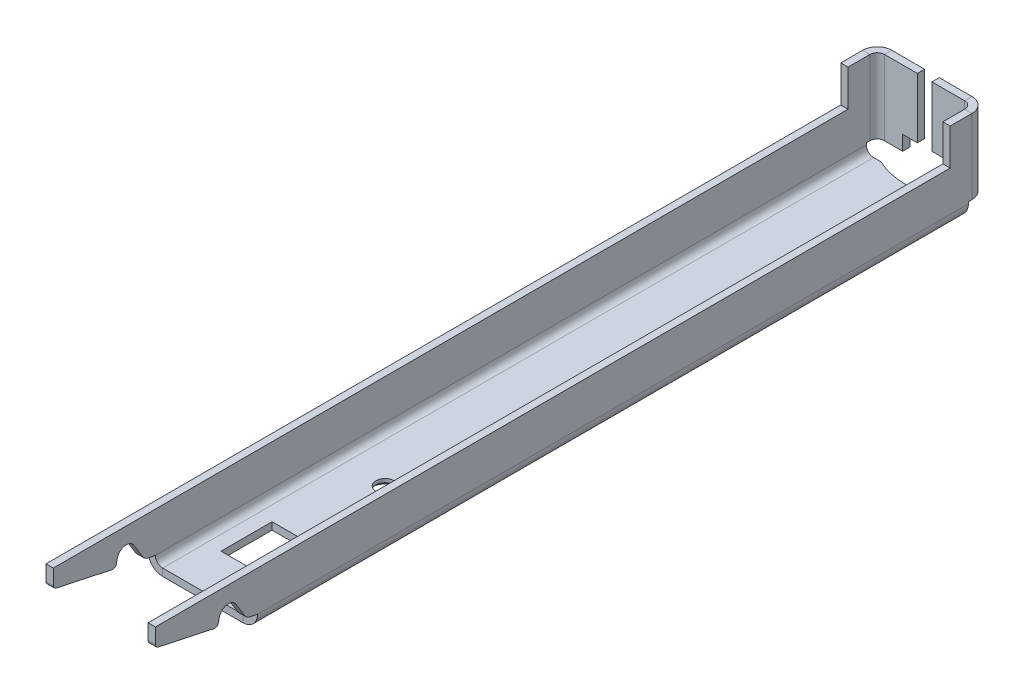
ISO-10303-21;
HEADER;
FILE_DESCRIPTION(('STEP AP214'),'2;1');
FILE_NAME('part.step','',(''),(''),'','','');
FILE_SCHEMA(('AUTOMOTIVE_DESIGN { 1 0 10303 214 1 1 1 1 }'));
ENDSEC;
DATA;
#1=APPLICATION_CONTEXT('core data for automotive mechanical design processes');
#2=APPLICATION_PROTOCOL_DEFINITION('international standard','automotive_design',2000,#1);
#3=PRODUCT_CONTEXT('',#1,'mechanical');
#4=PRODUCT('Part','Part','',(#3));
#5=PRODUCT_RELATED_PRODUCT_CATEGORY('part','',(#4));
#6=PRODUCT_DEFINITION_FORMATION('','',#4);
#7=PRODUCT_DEFINITION_CONTEXT('part definition',#1,'design');
#8=PRODUCT_DEFINITION('design','',#6,#7);
#9=PRODUCT_DEFINITION_SHAPE('','',#8);
#10=(LENGTH_UNIT() NAMED_UNIT(*) SI_UNIT(.MILLI.,.METRE.));
#11=(NAMED_UNIT(*) PLANE_ANGLE_UNIT() SI_UNIT($,.RADIAN.));
#12=(NAMED_UNIT(*) SI_UNIT($,.STERADIAN.) SOLID_ANGLE_UNIT());
#13=UNCERTAINTY_MEASURE_WITH_UNIT(LENGTH_MEASURE(1.E-05),#10,'distance_accuracy_value','');
#14=(GEOMETRIC_REPRESENTATION_CONTEXT(3) GLOBAL_UNCERTAINTY_ASSIGNED_CONTEXT((#13)) GLOBAL_UNIT_ASSIGNED_CONTEXT((#10,
#11,#12)) REPRESENTATION_CONTEXT('',''));
#15=CARTESIAN_POINT('',(0.,0.,0.));
#16=DIRECTION('',(0.,0.,1.));
#17=DIRECTION('',(1.,0.,0.));
#18=AXIS2_PLACEMENT_3D('',#15,#16,#17);
#19=CARTESIAN_POINT('',(-3.00000000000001,0.249999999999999,27.1007662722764));
#20=DIRECTION('',(-1.,0.,0.));
#21=DIRECTION('',(0.,-1.,0.));
#22=AXIS2_PLACEMENT_3D('',#19,#20,#21);
#23=PLANE('',#22);
#24=DIRECTION('',(0.,0.,1.));
#25=VECTOR('',#24,1.);
#26=CARTESIAN_POINT('',(-3.00000000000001,2.25000000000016,27.1007662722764));
#27=LINE('',#26,#25);
#28=CARTESIAN_POINT('',(-3.00000000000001,2.24999999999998,0.));
#29=VERTEX_POINT('',#28);
#30=CARTESIAN_POINT('',(-3.00000000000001,2.24999999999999,1.));
#31=VERTEX_POINT('',#30);
#32=EDGE_CURVE('E387',#29,#31,#27,.T.);
#33=ORIENTED_EDGE('',*,*,#32,.F.);
#34=DIRECTION('',(0.,1.,0.));
#35=VECTOR('',#34,1.);
#36=CARTESIAN_POINT('',(-3.00000000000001,0.249999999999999,0.));
#37=LINE('',#36,#35);
#38=CARTESIAN_POINT('',(-3.00000000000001,4.25,0.));
#39=VERTEX_POINT('',#38);
#40=EDGE_CURVE('E54',#29,#39,#37,.T.);
#41=ORIENTED_EDGE('',*,*,#40,.T.);
#42=DIRECTION('',(0.,0.,-1.));
#43=VECTOR('',#42,1.);
#44=CARTESIAN_POINT('',(-3.00000000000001,4.24999999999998,27.1007662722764));
#45=LINE('',#44,#43);
#46=CARTESIAN_POINT('',(-3.00000000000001,4.25,0.999999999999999));
#47=VERTEX_POINT('',#46);
#48=EDGE_CURVE('E850',#47,#39,#45,.T.);
#49=ORIENTED_EDGE('',*,*,#48,.F.);
#50=DIRECTION('',(0.,1.,0.));
#51=VECTOR('',#50,1.);
#52=CARTESIAN_POINT('',(-3.00000000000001,0.250000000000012,0.999999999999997));
#53=LINE('',#52,#51);
#54=EDGE_CURVE('E389',#31,#47,#53,.T.);
#55=ORIENTED_EDGE('',*,*,#54,.F.);
#56=EDGE_LOOP('',(#33,#41,#49,#55));
#57=FACE_BOUND('',#56,.T.);
#58=ADVANCED_FACE('F33',(#57),#23,.F.);
#59=CARTESIAN_POINT('',(-0.999999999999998,7.49999999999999,0.999999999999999));
#60=DIRECTION('',(0.,0.,1.));
#61=DIRECTION('',(0.,-1.,0.));
#62=AXIS2_PLACEMENT_3D('',#59,#60,#61);
#63=PLANE('',#62);
#64=DIRECTION('',(1.,0.,0.));
#65=VECTOR('',#64,1.);
#66=CARTESIAN_POINT('',(-1.,2.24999999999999,0.999999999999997));
#67=LINE('',#66,#65);
#68=CARTESIAN_POINT('',(-5.50000000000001,2.24999999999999,0.999999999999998));
#69=VERTEX_POINT('',#68);
#70=EDGE_CURVE('E376',#69,#31,#67,.T.);
#71=ORIENTED_EDGE('',*,*,#70,.T.);
#72=ORIENTED_EDGE('',*,*,#54,.T.);
#73=DIRECTION('',(1.,0.,0.));
#74=VECTOR('',#73,1.);
#75=CARTESIAN_POINT('',(3.,4.25,0.999999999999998));
#76=LINE('',#75,#74);
#77=CARTESIAN_POINT('',(-1.,4.25,0.999999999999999));
#78=VERTEX_POINT('',#77);
#79=EDGE_CURVE('E837',#47,#78,#76,.T.);
#80=ORIENTED_EDGE('',*,*,#79,.T.);
#81=DIRECTION('',(0.,1.,0.));
#82=VECTOR('',#81,1.);
#83=CARTESIAN_POINT('',(-0.999999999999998,7.49999999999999,0.999999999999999));
#84=LINE('',#83,#82);
#85=CARTESIAN_POINT('',(-0.999999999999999,12.5,1.));
#86=VERTEX_POINT('',#85);
#87=EDGE_CURVE('E840',#78,#86,#84,.T.);
#88=ORIENTED_EDGE('',*,*,#87,.T.);
#89=DIRECTION('',(-1.,0.,0.));
#90=VECTOR('',#89,1.);
#91=CARTESIAN_POINT('',(-0.999999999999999,12.5,1.));
#92=LINE('',#91,#90);
#93=CARTESIAN_POINT('',(-5.5,12.5,1.));
#94=VERTEX_POINT('',#93);
#95=EDGE_CURVE('E379',#86,#94,#92,.T.);
#96=ORIENTED_EDGE('',*,*,#95,.T.);
#97=DIRECTION('',(0.,1.,0.));
#98=VECTOR('',#97,1.);
#99=CARTESIAN_POINT('',(-5.50000000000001,2.24999999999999,0.999999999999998));
#100=LINE('',#99,#98);
#101=EDGE_CURVE('E374',#69,#94,#100,.T.);
#102=ORIENTED_EDGE('',*,*,#101,.F.);
#103=EDGE_LOOP('',(#71,#72,#80,#88,#96,#102));
#104=FACE_BOUND('',#103,.T.);
#105=ADVANCED_FACE('F375',(#104),#63,.T.);
#106=CARTESIAN_POINT('',(7.5,7.5,0.));
#107=DIRECTION('',(0.,0.,-1.));
#108=DIRECTION('',(-1.,0.,0.));
#109=AXIS2_PLACEMENT_3D('',#106,#107,#108);
#110=PLANE('',#109);
#111=ORIENTED_EDGE('',*,*,#40,.F.);
#112=DIRECTION('',(-1.,0.,0.));
#113=VECTOR('',#112,1.);
#114=CARTESIAN_POINT('',(7.49999999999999,2.24999999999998,0.));
#115=LINE('',#114,#113);
#116=CARTESIAN_POINT('',(-5.50000000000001,2.24999999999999,0.));
#117=VERTEX_POINT('',#116);
#118=EDGE_CURVE('E826',#29,#117,#115,.T.);
#119=ORIENTED_EDGE('',*,*,#118,.T.);
#120=DIRECTION('',(0.,-1.,0.));
#121=VECTOR('',#120,1.);
#122=CARTESIAN_POINT('',(-5.50000000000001,2.24999999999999,0.));
#123=LINE('',#122,#121);
#124=CARTESIAN_POINT('',(-5.5,12.5,0.));
#125=VERTEX_POINT('',#124);
#126=EDGE_CURVE('E390',#125,#117,#123,.T.);
#127=ORIENTED_EDGE('',*,*,#126,.F.);
#128=DIRECTION('',(1.,0.,0.));
#129=VECTOR('',#128,1.);
#130=CARTESIAN_POINT('',(-1.,12.5,0.));
#131=LINE('',#130,#129);
#132=CARTESIAN_POINT('',(-1.,12.5,0.));
#133=VERTEX_POINT('',#132);
#134=EDGE_CURVE('E41',#125,#133,#131,.T.);
#135=ORIENTED_EDGE('',*,*,#134,.T.);
#136=DIRECTION('',(0.,1.,0.));
#137=VECTOR('',#136,1.);
#138=CARTESIAN_POINT('',(-0.999999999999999,7.49999999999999,0.));
#139=LINE('',#138,#137);
#140=CARTESIAN_POINT('',(-1.,4.25,0.));
#141=VERTEX_POINT('',#140);
#142=EDGE_CURVE('E828',#141,#133,#139,.T.);
#143=ORIENTED_EDGE('',*,*,#142,.F.);
#144=DIRECTION('',(1.,0.,0.));
#145=VECTOR('',#144,1.);
#146=CARTESIAN_POINT('',(3.,4.25,0.));
#147=LINE('',#146,#145);
#148=EDGE_CURVE('E831',#39,#141,#147,.T.);
#149=ORIENTED_EDGE('',*,*,#148,.F.);
#150=EDGE_LOOP('',(#111,#119,#127,#135,#143,#149));
#151=FACE_BOUND('',#150,.T.);
#152=ADVANCED_FACE('F855',(#151),#110,.T.);
#153=CARTESIAN_POINT('',(-105.856194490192,2.24999999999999,198.121789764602));
#154=DIRECTION('',(0.,1.,0.));
#155=DIRECTION('',(0.,0.,-1.));
#156=AXIS2_PLACEMENT_3D('',#153,#154,#155);
#157=PLANE('',#156);
#158=DIRECTION('',(0.,0.,1.));
#159=VECTOR('',#158,1.);
#160=CARTESIAN_POINT('',(-5.49999999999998,2.2499999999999,198.121789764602));
#161=LINE('',#160,#159);
#162=EDGE_CURVE('E11',#117,#69,#161,.T.);
#163=ORIENTED_EDGE('',*,*,#162,.F.);
#164=ORIENTED_EDGE('',*,*,#118,.F.);
#165=ORIENTED_EDGE('',*,*,#32,.T.);
#166=ORIENTED_EDGE('',*,*,#70,.F.);
#167=EDGE_LOOP('',(#163,#164,#165,#166));
#168=FACE_BOUND('',#167,.T.);
#169=ADVANCED_FACE('F35',(#168),#157,.F.);
#170=CARTESIAN_POINT('',(3.,4.24999999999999,27.1007662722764));
#171=DIRECTION('',(0.,1.,0.));
#172=DIRECTION('',(-1.,0.,0.));
#173=AXIS2_PLACEMENT_3D('',#170,#171,#172);
#174=PLANE('',#173);
#175=ORIENTED_EDGE('',*,*,#148,.T.);
#176=DIRECTION('',(0.,0.,-1.));
#177=VECTOR('',#176,1.);
#178=CARTESIAN_POINT('',(-1.,4.24999999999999,27.1007662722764));
#179=LINE('',#178,#177);
#180=EDGE_CURVE('E847',#78,#141,#179,.T.);
#181=ORIENTED_EDGE('',*,*,#180,.F.);
#182=ORIENTED_EDGE('',*,*,#79,.F.);
#183=ORIENTED_EDGE('',*,*,#48,.T.);
#184=EDGE_LOOP('',(#175,#181,#182,#183));
#185=FACE_BOUND('',#184,.T.);
#186=ADVANCED_FACE('F865',(#185),#174,.F.);
#187=CARTESIAN_POINT('',(-0.999999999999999,7.49999999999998,27.1007662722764));
#188=DIRECTION('',(-1.,0.,0.));
#189=DIRECTION('',(0.,-1.,0.));
#190=AXIS2_PLACEMENT_3D('',#187,#188,#189);
#191=PLANE('',#190);
#192=ORIENTED_EDGE('',*,*,#142,.T.);
#193=DIRECTION('',(0.,0.,-1.));
#194=VECTOR('',#193,1.);
#195=CARTESIAN_POINT('',(-1.,12.5,27.1007662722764));
#196=LINE('',#195,#194);
#197=EDGE_CURVE('E845',#86,#133,#196,.T.);
#198=ORIENTED_EDGE('',*,*,#197,.F.);
#199=ORIENTED_EDGE('',*,*,#87,.F.);
#200=ORIENTED_EDGE('',*,*,#180,.T.);
#201=EDGE_LOOP('',(#192,#198,#199,#200));
#202=FACE_BOUND('',#201,.T.);
#203=ADVANCED_FACE('F861',(#202),#191,.F.);
#204=CARTESIAN_POINT('',(-1.,12.5,27.1007662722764));
#205=DIRECTION('',(0.,-1.,0.));
#206=DIRECTION('',(1.,0.,0.));
#207=AXIS2_PLACEMENT_3D('',#204,#205,#206);
#208=PLANE('',#207);
#209=ORIENTED_EDGE('',*,*,#134,.F.);
#210=DIRECTION('',(0.,0.,-1.));
#211=VECTOR('',#210,1.);
#212=CARTESIAN_POINT('',(-5.5,12.5,27.1007662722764));
#213=LINE('',#212,#211);
#214=EDGE_CURVE('E385',#94,#125,#213,.T.);
#215=ORIENTED_EDGE('',*,*,#214,.F.);
#216=ORIENTED_EDGE('',*,*,#95,.F.);
#217=ORIENTED_EDGE('',*,*,#197,.T.);
#218=EDGE_LOOP('',(#209,#215,#216,#217));
#219=FACE_BOUND('',#218,.T.);
#220=ADVANCED_FACE('F858',(#219),#208,.F.);
#221=CARTESIAN_POINT('',(3.,0.250000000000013,27.1007662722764));
#222=DIRECTION('',(-1.,0.,0.));
#223=DIRECTION('',(0.,-1.,0.));
#224=AXIS2_PLACEMENT_3D('',#221,#222,#223);
#225=PLANE('',#224);
#226=DIRECTION('',(0.,-1.,0.));
#227=VECTOR('',#226,1.);
#228=CARTESIAN_POINT('',(3.,0.249999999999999,0.));
#229=LINE('',#228,#227);
#230=CARTESIAN_POINT('',(3.,4.25,0.));
#231=VERTEX_POINT('',#230);
#232=CARTESIAN_POINT('',(3.,2.25000000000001,0.));
#233=VERTEX_POINT('',#232);
#234=EDGE_CURVE('E779',#231,#233,#229,.T.);
#235=ORIENTED_EDGE('',*,*,#234,.T.);
#236=DIRECTION('',(0.,0.,1.));
#237=VECTOR('',#236,1.);
#238=CARTESIAN_POINT('',(3.,2.24999999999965,27.1007662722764));
#239=LINE('',#238,#237);
#240=CARTESIAN_POINT('',(3.,2.24999999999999,1.));
#241=VERTEX_POINT('',#240);
#242=EDGE_CURVE('E776',#233,#241,#239,.T.);
#243=ORIENTED_EDGE('',*,*,#242,.T.);
#244=DIRECTION('',(0.,1.,0.));
#245=VECTOR('',#244,1.);
#246=CARTESIAN_POINT('',(3.,0.25,1.));
#247=LINE('',#246,#245);
#248=CARTESIAN_POINT('',(3.,4.25,0.999999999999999));
#249=VERTEX_POINT('',#248);
#250=EDGE_CURVE('E800',#241,#249,#247,.T.);
#251=ORIENTED_EDGE('',*,*,#250,.T.);
#252=DIRECTION('',(0.,0.,-1.));
#253=VECTOR('',#252,1.);
#254=CARTESIAN_POINT('',(3.,4.25000000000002,27.1007662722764));
#255=LINE('',#254,#253);
#256=EDGE_CURVE('E805',#249,#231,#255,.T.);
#257=ORIENTED_EDGE('',*,*,#256,.T.);
#258=EDGE_LOOP('',(#235,#243,#251,#257));
#259=FACE_BOUND('',#258,.T.);
#260=ADVANCED_FACE('F1047',(#259),#225,.T.);
#261=CARTESIAN_POINT('',(0.999999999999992,0.250000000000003,1.));
#262=DIRECTION('',(0.,0.,-1.));
#263=DIRECTION('',(-1.,0.,0.));
#264=AXIS2_PLACEMENT_3D('',#261,#262,#263);
#265=PLANE('',#264);
#266=ORIENTED_EDGE('',*,*,#250,.F.);
#267=DIRECTION('',(1.,0.,0.));
#268=VECTOR('',#267,1.);
#269=CARTESIAN_POINT('',(0.999999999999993,2.25,1.));
#270=LINE('',#269,#268);
#271=CARTESIAN_POINT('',(5.5,2.25,1.));
#272=VERTEX_POINT('',#271);
#273=EDGE_CURVE('E817',#241,#272,#270,.T.);
#274=ORIENTED_EDGE('',*,*,#273,.T.);
#275=DIRECTION('',(0.,1.,0.));
#276=VECTOR('',#275,1.);
#277=CARTESIAN_POINT('',(5.5,12.5,0.999999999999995));
#278=LINE('',#277,#276);
#279=CARTESIAN_POINT('',(5.5,12.5,0.999999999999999));
#280=VERTEX_POINT('',#279);
#281=EDGE_CURVE('E802',#272,#280,#278,.T.);
#282=ORIENTED_EDGE('',*,*,#281,.T.);
#283=DIRECTION('',(1.,0.,0.));
#284=VECTOR('',#283,1.);
#285=CARTESIAN_POINT('',(0.999999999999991,12.5,0.999999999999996));
#286=LINE('',#285,#284);
#287=CARTESIAN_POINT('',(0.999999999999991,12.5,0.999999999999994));
#288=VERTEX_POINT('',#287);
#289=EDGE_CURVE('E793',#288,#280,#286,.T.);
#290=ORIENTED_EDGE('',*,*,#289,.F.);
#291=DIRECTION('',(0.,1.,0.));
#292=VECTOR('',#291,1.);
#293=CARTESIAN_POINT('',(0.999999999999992,0.250000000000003,1.));
#294=LINE('',#293,#292);
#295=CARTESIAN_POINT('',(0.999999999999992,4.25,0.999999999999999));
#296=VERTEX_POINT('',#295);
#297=EDGE_CURVE('E796',#296,#288,#294,.T.);
#298=ORIENTED_EDGE('',*,*,#297,.F.);
#299=DIRECTION('',(-1.,0.,0.));
#300=VECTOR('',#299,1.);
#301=CARTESIAN_POINT('',(3.,4.25,1.));
#302=LINE('',#301,#300);
#303=EDGE_CURVE('E798',#249,#296,#302,.T.);
#304=ORIENTED_EDGE('',*,*,#303,.F.);
#305=EDGE_LOOP('',(#266,#274,#282,#290,#298,#304));
#306=FACE_BOUND('',#305,.T.);
#307=ADVANCED_FACE('F1067',(#306),#265,.F.);
#308=CARTESIAN_POINT('',(7.5,7.5,0.));
#309=DIRECTION('',(0.,0.,-1.));
#310=DIRECTION('',(-1.,0.,0.));
#311=AXIS2_PLACEMENT_3D('',#308,#309,#310);
#312=PLANE('',#311);
#313=DIRECTION('',(1.,0.,0.));
#314=VECTOR('',#313,1.);
#315=CARTESIAN_POINT('',(0.999999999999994,2.25,0.));
#316=LINE('',#315,#314);
#317=CARTESIAN_POINT('',(5.5,2.25,0.));
#318=VERTEX_POINT('',#317);
#319=EDGE_CURVE('E820',#233,#318,#316,.T.);
#320=ORIENTED_EDGE('',*,*,#319,.F.);
#321=ORIENTED_EDGE('',*,*,#234,.F.);
#322=DIRECTION('',(1.,0.,0.));
#323=VECTOR('',#322,1.);
#324=CARTESIAN_POINT('',(3.,4.25,0.));
#325=LINE('',#324,#323);
#326=CARTESIAN_POINT('',(0.999999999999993,4.25,0.));
#327=VERTEX_POINT('',#326);
#328=EDGE_CURVE('E782',#327,#231,#325,.T.);
#329=ORIENTED_EDGE('',*,*,#328,.F.);
#330=DIRECTION('',(0.,1.,0.));
#331=VECTOR('',#330,1.);
#332=CARTESIAN_POINT('',(0.999999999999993,0.250000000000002,0.));
#333=LINE('',#332,#331);
#334=CARTESIAN_POINT('',(0.999999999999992,12.5,0.));
#335=VERTEX_POINT('',#334);
#336=EDGE_CURVE('E785',#327,#335,#333,.T.);
#337=ORIENTED_EDGE('',*,*,#336,.T.);
#338=DIRECTION('',(-1.,0.,0.));
#339=VECTOR('',#338,1.);
#340=CARTESIAN_POINT('',(0.999999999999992,12.5,0.));
#341=LINE('',#340,#339);
#342=CARTESIAN_POINT('',(5.5,12.5,0.));
#343=VERTEX_POINT('',#342);
#344=EDGE_CURVE('E787',#343,#335,#341,.T.);
#345=ORIENTED_EDGE('',*,*,#344,.F.);
#346=DIRECTION('',(0.,1.,0.));
#347=VECTOR('',#346,1.);
#348=CARTESIAN_POINT('',(5.5,12.5,0.));
#349=LINE('',#348,#347);
#350=EDGE_CURVE('E790',#318,#343,#349,.T.);
#351=ORIENTED_EDGE('',*,*,#350,.F.);
#352=EDGE_LOOP('',(#320,#321,#329,#337,#345,#351));
#353=FACE_BOUND('',#352,.T.);
#354=ADVANCED_FACE('F1003',(#353),#312,.T.);
#355=CARTESIAN_POINT('',(105.856194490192,2.25000000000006,198.121789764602));
#356=DIRECTION('',(0.,1.,0.));
#357=DIRECTION('',(0.,0.,1.));
#358=AXIS2_PLACEMENT_3D('',#355,#356,#357);
#359=PLANE('',#358);
#360=DIRECTION('',(0.,0.,-1.));
#361=VECTOR('',#360,1.);
#362=CARTESIAN_POINT('',(5.49999999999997,2.2500000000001,198.121789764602));
#363=LINE('',#362,#361);
#364=EDGE_CURVE('E823',#272,#318,#363,.T.);
#365=ORIENTED_EDGE('',*,*,#364,.F.);
#366=ORIENTED_EDGE('',*,*,#273,.F.);
#367=ORIENTED_EDGE('',*,*,#242,.F.);
#368=ORIENTED_EDGE('',*,*,#319,.T.);
#369=EDGE_LOOP('',(#365,#366,#367,#368));
#370=FACE_BOUND('',#369,.T.);
#371=ADVANCED_FACE('F1051',(#370),#359,.F.);
#372=CARTESIAN_POINT('',(0.999999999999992,12.5,27.1007662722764));
#373=DIRECTION('',(0.,1.,0.));
#374=DIRECTION('',(-1.,0.,0.));
#375=AXIS2_PLACEMENT_3D('',#372,#373,#374);
#376=PLANE('',#375);
#377=DIRECTION('',(0.,0.,-1.));
#378=VECTOR('',#377,1.);
#379=CARTESIAN_POINT('',(5.5,12.5,27.1007662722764));
#380=LINE('',#379,#378);
#381=EDGE_CURVE('E814',#280,#343,#380,.T.);
#382=ORIENTED_EDGE('',*,*,#381,.T.);
#383=ORIENTED_EDGE('',*,*,#344,.T.);
#384=DIRECTION('',(0.,0.,-1.));
#385=VECTOR('',#384,1.);
#386=CARTESIAN_POINT('',(0.999999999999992,12.5,27.1007662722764));
#387=LINE('',#386,#385);
#388=EDGE_CURVE('E811',#288,#335,#387,.T.);
#389=ORIENTED_EDGE('',*,*,#388,.F.);
#390=ORIENTED_EDGE('',*,*,#289,.T.);
#391=EDGE_LOOP('',(#382,#383,#389,#390));
#392=FACE_BOUND('',#391,.T.);
#393=ADVANCED_FACE('F1007',(#392),#376,.T.);
#394=CARTESIAN_POINT('',(0.999999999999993,0.250000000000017,27.1007662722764));
#395=DIRECTION('',(-1.,0.,0.));
#396=DIRECTION('',(0.,-1.,0.));
#397=AXIS2_PLACEMENT_3D('',#394,#395,#396);
#398=PLANE('',#397);
#399=ORIENTED_EDGE('',*,*,#388,.T.);
#400=ORIENTED_EDGE('',*,*,#336,.F.);
#401=DIRECTION('',(0.,0.,-1.));
#402=VECTOR('',#401,1.);
#403=CARTESIAN_POINT('',(0.999999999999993,4.25000000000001,27.1007662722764));
#404=LINE('',#403,#402);
#405=EDGE_CURVE('E808',#296,#327,#404,.T.);
#406=ORIENTED_EDGE('',*,*,#405,.F.);
#407=ORIENTED_EDGE('',*,*,#297,.T.);
#408=EDGE_LOOP('',(#399,#400,#406,#407));
#409=FACE_BOUND('',#408,.T.);
#410=ADVANCED_FACE('F1057',(#409),#398,.T.);
#411=CARTESIAN_POINT('',(3.,4.25000000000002,27.1007662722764));
#412=DIRECTION('',(0.,-1.,0.));
#413=DIRECTION('',(1.,0.,0.));
#414=AXIS2_PLACEMENT_3D('',#411,#412,#413);
#415=PLANE('',#414);
#416=ORIENTED_EDGE('',*,*,#405,.T.);
#417=ORIENTED_EDGE('',*,*,#328,.T.);
#418=ORIENTED_EDGE('',*,*,#256,.F.);
#419=ORIENTED_EDGE('',*,*,#303,.T.);
#420=EDGE_LOOP('',(#416,#417,#418,#419));
#421=FACE_BOUND('',#420,.T.);
#422=ADVANCED_FACE('F1060',(#421),#415,.T.);
#423=CARTESIAN_POINT('',(190.621789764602,2.24999999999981,100.));
#424=DIRECTION('',(0.,1.,0.));
#425=DIRECTION('',(-1.,0.,0.));
#426=AXIS2_PLACEMENT_3D('',#423,#424,#425);
#427=PLANE('',#426);
#428=DIRECTION('',(0.,0.,-1.));
#429=VECTOR('',#428,1.);
#430=CARTESIAN_POINT('',(-7.5,2.25,100.));
#431=LINE('',#430,#429);
#432=CARTESIAN_POINT('',(-7.49999999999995,2.25,2.49999999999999));
#433=VERTEX_POINT('',#432);
#434=CARTESIAN_POINT('',(-7.50000000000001,2.24999999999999,2.));
#435=VERTEX_POINT('',#434);
#436=EDGE_CURVE('E727',#433,#435,#431,.T.);
#437=ORIENTED_EDGE('',*,*,#436,.T.);
#438=DIRECTION('',(1.,0.,0.));
#439=VECTOR('',#438,1.);
#440=CARTESIAN_POINT('',(190.621789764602,2.24999999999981,1.99999999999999));
#441=LINE('',#440,#439);
#442=CARTESIAN_POINT('',(-6.50000000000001,2.24999999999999,2.));
#443=VERTEX_POINT('',#442);
#444=EDGE_CURVE('E774',#435,#443,#441,.T.);
#445=ORIENTED_EDGE('',*,*,#444,.T.);
#446=DIRECTION('',(0.,0.,-1.));
#447=VECTOR('',#446,1.);
#448=CARTESIAN_POINT('',(-6.5,2.25,100.));
#449=LINE('',#448,#447);
#450=CARTESIAN_POINT('',(-6.5,2.25,2.49999999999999));
#451=VERTEX_POINT('',#450);
#452=EDGE_CURVE('E735',#451,#443,#449,.T.);
#453=ORIENTED_EDGE('',*,*,#452,.F.);
#454=DIRECTION('',(-1.,0.,0.));
#455=VECTOR('',#454,1.);
#456=CARTESIAN_POINT('',(190.621789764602,2.24999999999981,2.49999999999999));
#457=LINE('',#456,#455);
#458=EDGE_CURVE('E750',#451,#433,#457,.T.);
#459=ORIENTED_EDGE('',*,*,#458,.T.);
#460=EDGE_LOOP('',(#437,#445,#453,#459));
#461=FACE_BOUND('',#460,.T.);
#462=ADVANCED_FACE('F884',(#461),#427,.F.);
#463=CARTESIAN_POINT('',(190.267560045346,1.64380550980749,2.49999999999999));
#464=DIRECTION('',(0.,0.,1.));
#465=DIRECTION('',(0.,-1.,0.));
#466=AXIS2_PLACEMENT_3D('',#463,#464,#465);
#467=PLANE('',#466);
#468=DIRECTION('',(1.,0.,0.));
#469=VECTOR('',#468,1.);
#470=CARTESIAN_POINT('',(190.267560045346,1.99999999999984,2.49999999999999));
#471=LINE('',#470,#469);
#472=CARTESIAN_POINT('',(-7.5,2.,2.49999999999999));
#473=VERTEX_POINT('',#472);
#474=CARTESIAN_POINT('',(-6.5,2.,2.49999999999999));
#475=VERTEX_POINT('',#474);
#476=EDGE_CURVE('E771',#473,#475,#471,.T.);
#477=ORIENTED_EDGE('',*,*,#476,.F.);
#478=DIRECTION('',(0.,1.,0.));
#479=VECTOR('',#478,1.);
#480=CARTESIAN_POINT('',(-7.5,7.5,2.49999999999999));
#481=LINE('',#480,#479);
#482=EDGE_CURVE('E768',#473,#433,#481,.T.);
#483=ORIENTED_EDGE('',*,*,#482,.T.);
#484=ORIENTED_EDGE('',*,*,#458,.F.);
#485=DIRECTION('',(0.,1.,0.));
#486=VECTOR('',#485,1.);
#487=CARTESIAN_POINT('',(-6.5,7.5,2.49999999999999));
#488=LINE('',#487,#486);
#489=EDGE_CURVE('E765',#475,#451,#488,.T.);
#490=ORIENTED_EDGE('',*,*,#489,.F.);
#491=EDGE_LOOP('',(#477,#483,#484,#490));
#492=FACE_BOUND('',#491,.T.);
#493=ADVANCED_FACE('F888',(#492),#467,.F.);
#494=CARTESIAN_POINT('',(190.621789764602,12.4999999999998,5.));
#495=DIRECTION('',(0.,-1.,0.));
#496=DIRECTION('',(1.,0.,0.));
#497=AXIS2_PLACEMENT_3D('',#494,#495,#496);
#498=PLANE('',#497);
#499=DIRECTION('',(-1.,0.,0.));
#500=VECTOR('',#499,1.);
#501=CARTESIAN_POINT('',(190.621789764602,12.4999999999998,2.));
#502=LINE('',#501,#500);
#503=CARTESIAN_POINT('',(-6.5,12.5,2.));
#504=VERTEX_POINT('',#503);
#505=CARTESIAN_POINT('',(-7.49999999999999,12.5,2.));
#506=VERTEX_POINT('',#505);
#507=EDGE_CURVE('E762',#504,#506,#502,.T.);
#508=ORIENTED_EDGE('',*,*,#507,.T.);
#509=DIRECTION('',(0.,0.,-1.));
#510=VECTOR('',#509,1.);
#511=CARTESIAN_POINT('',(-7.49999999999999,12.5,5.));
#512=LINE('',#511,#510);
#513=CARTESIAN_POINT('',(-7.49999999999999,12.5,5.));
#514=VERTEX_POINT('',#513);
#515=EDGE_CURVE('E724',#514,#506,#512,.T.);
#516=ORIENTED_EDGE('',*,*,#515,.F.);
#517=DIRECTION('',(-1.,0.,0.));
#518=VECTOR('',#517,1.);
#519=CARTESIAN_POINT('',(190.621789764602,12.4999999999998,5.));
#520=LINE('',#519,#518);
#521=CARTESIAN_POINT('',(-6.49999999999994,12.5,5.));
#522=VERTEX_POINT('',#521);
#523=EDGE_CURVE('E759',#522,#514,#520,.T.);
#524=ORIENTED_EDGE('',*,*,#523,.F.);
#525=DIRECTION('',(0.,0.,1.));
#526=VECTOR('',#525,1.);
#527=CARTESIAN_POINT('',(-6.49999999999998,12.5,5.));
#528=LINE('',#527,#526);
#529=EDGE_CURVE('E738',#504,#522,#528,.T.);
#530=ORIENTED_EDGE('',*,*,#529,.F.);
#531=EDGE_LOOP('',(#508,#516,#524,#530));
#532=FACE_BOUND('',#531,.T.);
#533=ADVANCED_FACE('F878',(#532),#498,.F.);
#534=CARTESIAN_POINT('',(190.621789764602,20.7006097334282,5.));
#535=DIRECTION('',(0.,0.,-1.));
#536=DIRECTION('',(0.,1.,0.));
#537=AXIS2_PLACEMENT_3D('',#534,#535,#536);
#538=PLANE('',#537);
#539=ORIENTED_EDGE('',*,*,#523,.T.);
#540=DIRECTION('',(0.,-1.,0.));
#541=VECTOR('',#540,1.);
#542=CARTESIAN_POINT('',(-7.49999999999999,20.7006097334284,5.));
#543=LINE('',#542,#541);
#544=CARTESIAN_POINT('',(-7.5,7.49999999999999,5.));
#545=VERTEX_POINT('',#544);
#546=EDGE_CURVE('E721',#514,#545,#543,.T.);
#547=ORIENTED_EDGE('',*,*,#546,.T.);
#548=DIRECTION('',(-1.,0.,0.));
#549=VECTOR('',#548,1.);
#550=CARTESIAN_POINT('',(190.621789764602,7.49999999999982,5.));
#551=LINE('',#550,#549);
#552=CARTESIAN_POINT('',(-6.49999999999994,7.5,5.));
#553=VERTEX_POINT('',#552);
#554=EDGE_CURVE('E756',#553,#545,#551,.T.);
#555=ORIENTED_EDGE('',*,*,#554,.F.);
#556=DIRECTION('',(0.,-1.,0.));
#557=VECTOR('',#556,1.);
#558=CARTESIAN_POINT('',(-6.49999999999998,20.7006097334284,5.));
#559=LINE('',#558,#557);
#560=EDGE_CURVE('E741',#522,#553,#559,.T.);
#561=ORIENTED_EDGE('',*,*,#560,.F.);
#562=EDGE_LOOP('',(#539,#547,#555,#561));
#563=FACE_BOUND('',#562,.T.);
#564=ADVANCED_FACE('F1080',(#563),#538,.F.);
#565=CARTESIAN_POINT('',(190.621789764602,7.49999999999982,100.));
#566=DIRECTION('',(0.,1.,0.));
#567=DIRECTION('',(-1.,0.,0.));
#568=AXIS2_PLACEMENT_3D('',#565,#566,#567);
#569=PLANE('',#568);
#570=DIRECTION('',(0.,0.,-1.));
#571=VECTOR('',#570,1.);
#572=CARTESIAN_POINT('',(-7.5,7.5,100.));
#573=LINE('',#572,#571);
#574=CARTESIAN_POINT('',(-7.5,7.5,114.));
#575=VERTEX_POINT('',#574);
#576=EDGE_CURVE('E719',#575,#545,#573,.T.);
#577=ORIENTED_EDGE('',*,*,#576,.F.);
#578=DIRECTION('',(1.,0.,0.));
#579=VECTOR('',#578,1.);
#580=CARTESIAN_POINT('',(-22.5416089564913,7.50000000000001,114.));
#581=LINE('',#580,#579);
#582=CARTESIAN_POINT('',(-6.5,7.5,114.));
#583=VERTEX_POINT('',#582);
#584=EDGE_CURVE('E658',#575,#583,#581,.T.);
#585=ORIENTED_EDGE('',*,*,#584,.T.);
#586=DIRECTION('',(0.,0.,-1.));
#587=VECTOR('',#586,1.);
#588=CARTESIAN_POINT('',(-6.5,7.5,100.));
#589=LINE('',#588,#587);
#590=EDGE_CURVE('E744',#583,#553,#589,.T.);
#591=ORIENTED_EDGE('',*,*,#590,.T.);
#592=ORIENTED_EDGE('',*,*,#554,.T.);
#593=EDGE_LOOP('',(#577,#585,#591,#592));
#594=FACE_BOUND('',#593,.T.);
#595=ADVANCED_FACE('F1083',(#594),#569,.T.);
#596=CARTESIAN_POINT('',(-6.5,7.5,100.));
#597=DIRECTION('',(1.,0.,0.));
#598=DIRECTION('',(0.,1.,0.));
#599=AXIS2_PLACEMENT_3D('',#596,#597,#598);
#600=PLANE('',#599);
#601=ORIENTED_EDGE('',*,*,#452,.T.);
#602=DIRECTION('',(0.,1.,0.));
#603=VECTOR('',#602,1.);
#604=CARTESIAN_POINT('',(-6.5,2.25,2.));
#605=LINE('',#604,#603);
#606=EDGE_CURVE('E401',#443,#504,#605,.T.);
#607=ORIENTED_EDGE('',*,*,#606,.T.);
#608=ORIENTED_EDGE('',*,*,#529,.T.);
#609=ORIENTED_EDGE('',*,*,#560,.T.);
#610=ORIENTED_EDGE('',*,*,#590,.F.);
#611=DIRECTION('',(0.,-1.,0.));
#612=VECTOR('',#611,1.);
#613=CARTESIAN_POINT('',(-6.5,7.5,114.));
#614=LINE('',#613,#612);
#615=CARTESIAN_POINT('',(-6.5,5.40420789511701,114.));
#616=VERTEX_POINT('',#615);
#617=EDGE_CURVE('E654',#583,#616,#614,.T.);
#618=ORIENTED_EDGE('',*,*,#617,.T.);
#619=CARTESIAN_POINT('',(-6.5,5.40420789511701,113.5));
#620=DIRECTION('',(1.,0.,0.));
#621=DIRECTION('',(0.,1.,0.));
#622=AXIS2_PLACEMENT_3D('',#619,#620,#621);
#623=CIRCLE('',#622,0.5);
#624=CARTESIAN_POINT('',(-6.5,4.9153066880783,113.604764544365));
#625=VERTEX_POINT('',#624);
#626=EDGE_CURVE('E676',#616,#625,#623,.T.);
#627=ORIENTED_EDGE('',*,*,#626,.T.);
#628=DIRECTION('',(0.,-0.209529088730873,-0.97780241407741));
#629=VECTOR('',#628,1.);
#630=CARTESIAN_POINT('',(-6.5,4.9153066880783,113.604764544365));
#631=LINE('',#630,#629);
#632=CARTESIAN_POINT('',(-6.5,3.27399297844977,105.945300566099));
#633=VERTEX_POINT('',#632);
#634=EDGE_CURVE('E679',#625,#633,#631,.T.);
#635=ORIENTED_EDGE('',*,*,#634,.T.);
#636=CARTESIAN_POINT('',(-6.5,3.76289418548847,105.840536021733));
#637=DIRECTION('',(1.,0.,0.));
#638=DIRECTION('',(0.,-1.,0.));
#639=AXIS2_PLACEMENT_3D('',#636,#637,#638);
#640=CIRCLE('',#639,0.499999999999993);
#641=CARTESIAN_POINT('',(-6.5,3.65812964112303,105.351634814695));
#642=VERTEX_POINT('',#641);
#643=EDGE_CURVE('E682',#633,#642,#640,.T.);
#644=ORIENTED_EDGE('',*,*,#643,.T.);
#645=DIRECTION('',(0.,0.977802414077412,-0.209529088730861));
#646=VECTOR('',#645,1.);
#647=CARTESIAN_POINT('',(-6.5,3.65812964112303,105.351634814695));
#648=LINE('',#647,#646);
#649=CARTESIAN_POINT('',(-6.5,4.26191136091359,105.222253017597));
#650=VERTEX_POINT('',#649);
#651=EDGE_CURVE('E685',#642,#650,#648,.T.);
#652=ORIENTED_EDGE('',*,*,#651,.T.);
#653=CARTESIAN_POINT('',(-6.5,4.,104.));
#654=DIRECTION('',(-1.,0.,0.));
#655=DIRECTION('',(0.,1.,0.));
#656=AXIS2_PLACEMENT_3D('',#653,#654,#655);
#657=CIRCLE('',#656,1.25000000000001);
#658=CARTESIAN_POINT('',(-6.5,4.65489282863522,102.935286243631));
#659=VERTEX_POINT('',#658);
#660=EDGE_CURVE('E688',#650,#659,#657,.T.);
#661=ORIENTED_EDGE('',*,*,#660,.T.);
#662=DIRECTION('',(0.,-0.851771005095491,-0.523914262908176));
#663=VECTOR('',#662,1.);
#664=CARTESIAN_POINT('',(-6.5,2.68570703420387,101.724063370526));
#665=LINE('',#664,#663);
#666=CARTESIAN_POINT('',(-6.5,2.68570703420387,101.724063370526));
#667=VERTEX_POINT('',#666);
#668=EDGE_CURVE('E691',#659,#667,#665,.T.);
#669=ORIENTED_EDGE('',*,*,#668,.T.);
#670=CARTESIAN_POINT('',(-6.5,3.20962129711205,100.872292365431));
#671=DIRECTION('',(1.,0.,0.));
#672=DIRECTION('',(0.,1.,0.));
#673=AXIS2_PLACEMENT_3D('',#670,#671,#672);
#674=CIRCLE('',#673,1.);
#675=CARTESIAN_POINT('',(-6.5,2.23181888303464,101.081821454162));
#676=VERTEX_POINT('',#675);
#677=EDGE_CURVE('E694',#667,#676,#674,.T.);
#678=ORIENTED_EDGE('',*,*,#677,.T.);
#679=DIRECTION('',(0.,-0.209529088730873,-0.97780241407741));
#680=VECTOR('',#679,1.);
#681=CARTESIAN_POINT('',(-6.5,2.23181888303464,101.081821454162));
#682=LINE('',#681,#680);
#683=CARTESIAN_POINT('',(-6.5,2.,100.));
#684=VERTEX_POINT('',#683);
#685=EDGE_CURVE('E697',#676,#684,#682,.T.);
#686=ORIENTED_EDGE('',*,*,#685,.T.);
#687=DIRECTION('',(0.,0.,1.));
#688=VECTOR('',#687,1.);
#689=CARTESIAN_POINT('',(-6.5,2.,2.49999999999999));
#690=LINE('',#689,#688);
#691=EDGE_CURVE('E746',#475,#684,#690,.T.);
#692=ORIENTED_EDGE('',*,*,#691,.F.);
#693=ORIENTED_EDGE('',*,*,#489,.T.);
#694=EDGE_LOOP('',(#601,#607,#608,#609,#610,#618,#627,#635,#644,#652,#661,#669,#678,#686,#692,#693));
#695=FACE_BOUND('',#694,.T.);
#696=ADVANCED_FACE('F880',(#695),#600,.T.);
#697=CARTESIAN_POINT('',(-7.5,7.5,100.));
#698=DIRECTION('',(1.,0.,0.));
#699=DIRECTION('',(0.,1.,0.));
#700=AXIS2_PLACEMENT_3D('',#697,#698,#699);
#701=PLANE('',#700);
#702=DIRECTION('',(0.,1.,0.));
#703=VECTOR('',#702,1.);
#704=CARTESIAN_POINT('',(-7.5,2.25,2.));
#705=LINE('',#704,#703);
#706=EDGE_CURVE('E733',#435,#506,#705,.T.);
#707=ORIENTED_EDGE('',*,*,#706,.F.);
#708=ORIENTED_EDGE('',*,*,#436,.F.);
#709=ORIENTED_EDGE('',*,*,#482,.F.);
#710=DIRECTION('',(0.,0.,1.));
#711=VECTOR('',#710,1.);
#712=CARTESIAN_POINT('',(-7.5,2.,2.49999999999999));
#713=LINE('',#712,#711);
#714=CARTESIAN_POINT('',(-7.5,2.,100.));
#715=VERTEX_POINT('',#714);
#716=EDGE_CURVE('E730',#473,#715,#713,.T.);
#717=ORIENTED_EDGE('',*,*,#716,.T.);
#718=DIRECTION('',(0.,0.209529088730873,0.97780241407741));
#719=VECTOR('',#718,1.);
#720=CARTESIAN_POINT('',(-7.5,2.23181888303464,101.081821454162));
#721=LINE('',#720,#719);
#722=CARTESIAN_POINT('',(-7.5,2.23181888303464,101.081821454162));
#723=VERTEX_POINT('',#722);
#724=EDGE_CURVE('E668',#715,#723,#721,.T.);
#725=ORIENTED_EDGE('',*,*,#724,.T.);
#726=CARTESIAN_POINT('',(-7.5,3.20962129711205,100.872292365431));
#727=DIRECTION('',(1.,0.,0.));
#728=DIRECTION('',(0.,1.,0.));
#729=AXIS2_PLACEMENT_3D('',#726,#727,#728);
#730=CIRCLE('',#729,1.);
#731=CARTESIAN_POINT('',(-7.5,2.68570703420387,101.724063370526));
#732=VERTEX_POINT('',#731);
#733=EDGE_CURVE('E666',#723,#732,#730,.F.);
#734=ORIENTED_EDGE('',*,*,#733,.T.);
#735=DIRECTION('',(0.,0.851771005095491,0.523914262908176));
#736=VECTOR('',#735,1.);
#737=CARTESIAN_POINT('',(-7.5,2.68570703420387,101.724063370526));
#738=LINE('',#737,#736);
#739=CARTESIAN_POINT('',(-7.5,4.65489282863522,102.935286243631));
#740=VERTEX_POINT('',#739);
#741=EDGE_CURVE('E664',#732,#740,#738,.T.);
#742=ORIENTED_EDGE('',*,*,#741,.T.);
#743=CARTESIAN_POINT('',(-7.5,4.,104.));
#744=DIRECTION('',(1.,0.,0.));
#745=DIRECTION('',(0.,1.,0.));
#746=AXIS2_PLACEMENT_3D('',#743,#744,#745);
#747=CIRCLE('',#746,1.25000000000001);
#748=CARTESIAN_POINT('',(-7.5,4.26191136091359,105.222253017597));
#749=VERTEX_POINT('',#748);
#750=EDGE_CURVE('E662',#740,#749,#747,.T.);
#751=ORIENTED_EDGE('',*,*,#750,.T.);
#752=DIRECTION('',(0.,-0.977802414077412,0.209529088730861));
#753=VECTOR('',#752,1.);
#754=CARTESIAN_POINT('',(-7.5,3.65812964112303,105.351634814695));
#755=LINE('',#754,#753);
#756=CARTESIAN_POINT('',(-7.5,3.65812964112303,105.351634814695));
#757=VERTEX_POINT('',#756);
#758=EDGE_CURVE('E660',#749,#757,#755,.T.);
#759=ORIENTED_EDGE('',*,*,#758,.T.);
#760=CARTESIAN_POINT('',(-7.5,3.76289418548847,105.840536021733));
#761=DIRECTION('',(1.,0.,0.));
#762=DIRECTION('',(0.,1.,0.));
#763=AXIS2_PLACEMENT_3D('',#760,#761,#762);
#764=CIRCLE('',#763,0.499999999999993);
#765=CARTESIAN_POINT('',(-7.5,3.27399297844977,105.945300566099));
#766=VERTEX_POINT('',#765);
#767=EDGE_CURVE('E657',#757,#766,#764,.F.);
#768=ORIENTED_EDGE('',*,*,#767,.T.);
#769=DIRECTION('',(0.,0.209529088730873,0.97780241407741));
#770=VECTOR('',#769,1.);
#771=CARTESIAN_POINT('',(-7.5,4.9153066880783,113.604764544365));
#772=LINE('',#771,#770);
#773=CARTESIAN_POINT('',(-7.5,4.9153066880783,113.604764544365));
#774=VERTEX_POINT('',#773);
#775=EDGE_CURVE('E655',#766,#774,#772,.T.);
#776=ORIENTED_EDGE('',*,*,#775,.T.);
#777=CARTESIAN_POINT('',(-7.5,5.40420789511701,113.5));
#778=DIRECTION('',(1.,0.,0.));
#779=DIRECTION('',(0.,1.,0.));
#780=AXIS2_PLACEMENT_3D('',#777,#778,#779);
#781=CIRCLE('',#780,0.5);
#782=CARTESIAN_POINT('',(-7.5,5.40420789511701,114.));
#783=VERTEX_POINT('',#782);
#784=EDGE_CURVE('E673',#774,#783,#781,.F.);
#785=ORIENTED_EDGE('',*,*,#784,.T.);
#786=DIRECTION('',(0.,1.,0.));
#787=VECTOR('',#786,1.);
#788=CARTESIAN_POINT('',(-7.5,7.5,114.));
#789=LINE('',#788,#787);
#790=EDGE_CURVE('E670',#783,#575,#789,.T.);
#791=ORIENTED_EDGE('',*,*,#790,.T.);
#792=ORIENTED_EDGE('',*,*,#576,.T.);
#793=ORIENTED_EDGE('',*,*,#546,.F.);
#794=ORIENTED_EDGE('',*,*,#515,.T.);
#795=EDGE_LOOP('',(#707,#708,#709,#717,#725,#734,#742,#751,#759,#768,#776,#785,#791,#792,#793,#794));
#796=FACE_BOUND('',#795,.T.);
#797=ADVANCED_FACE('F874',(#796),#701,.F.);
#798=CARTESIAN_POINT('',(-22.5416089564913,7.50000000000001,114.));
#799=DIRECTION('',(0.,0.,1.));
#800=DIRECTION('',(0.,-1.,0.));
#801=AXIS2_PLACEMENT_3D('',#798,#799,#800);
#802=PLANE('',#801);
#803=ORIENTED_EDGE('',*,*,#790,.F.);
#804=DIRECTION('',(1.,0.,0.));
#805=VECTOR('',#804,1.);
#806=CARTESIAN_POINT('',(-22.5416089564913,5.40420789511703,114.));
#807=LINE('',#806,#805);
#808=EDGE_CURVE('E700',#783,#616,#807,.T.);
#809=ORIENTED_EDGE('',*,*,#808,.T.);
#810=ORIENTED_EDGE('',*,*,#617,.F.);
#811=ORIENTED_EDGE('',*,*,#584,.F.);
#812=EDGE_LOOP('',(#803,#809,#810,#811));
#813=FACE_BOUND('',#812,.T.);
#814=ADVANCED_FACE('F1092',(#813),#802,.T.);
#815=CARTESIAN_POINT('',(-22.5416089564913,2.23181888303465,101.081821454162));
#816=DIRECTION('',(0.,-0.97780241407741,0.209529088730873));
#817=DIRECTION('',(0.,-0.209529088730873,-0.97780241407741));
#818=AXIS2_PLACEMENT_3D('',#815,#816,#817);
#819=PLANE('',#818);
#820=ORIENTED_EDGE('',*,*,#724,.F.);
#821=DIRECTION('',(-1.,0.,0.));
#822=VECTOR('',#821,1.);
#823=CARTESIAN_POINT('',(190.621789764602,1.99999999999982,100.));
#824=LINE('',#823,#822);
#825=EDGE_CURVE('E753',#684,#715,#824,.T.);
#826=ORIENTED_EDGE('',*,*,#825,.F.);
#827=ORIENTED_EDGE('',*,*,#685,.F.);
#828=DIRECTION('',(1.,0.,0.));
#829=VECTOR('',#828,1.);
#830=CARTESIAN_POINT('',(-22.5416089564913,2.23181888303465,101.081821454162));
#831=LINE('',#830,#829);
#832=EDGE_CURVE('E703',#723,#676,#831,.T.);
#833=ORIENTED_EDGE('',*,*,#832,.F.);
#834=EDGE_LOOP('',(#820,#826,#827,#833));
#835=FACE_BOUND('',#834,.T.);
#836=ADVANCED_FACE('F1095',(#835),#819,.T.);
#837=CARTESIAN_POINT('',(-22.5416089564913,3.20962129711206,100.872292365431));
#838=DIRECTION('',(1.,0.,0.));
#839=DIRECTION('',(0.,1.,0.));
#840=AXIS2_PLACEMENT_3D('',#837,#838,#839);
#841=CYLINDRICAL_SURFACE('',#840,1.);
#842=ORIENTED_EDGE('',*,*,#733,.F.);
#843=ORIENTED_EDGE('',*,*,#832,.T.);
#844=ORIENTED_EDGE('',*,*,#677,.F.);
#845=DIRECTION('',(1.,0.,0.));
#846=VECTOR('',#845,1.);
#847=CARTESIAN_POINT('',(-22.5416089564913,2.68570703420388,101.724063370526));
#848=LINE('',#847,#846);
#849=EDGE_CURVE('E705',#732,#667,#848,.T.);
#850=ORIENTED_EDGE('',*,*,#849,.F.);
#851=EDGE_LOOP('',(#842,#843,#844,#850));
#852=FACE_BOUND('',#851,.T.);
#853=ADVANCED_FACE('F1120',(#852),#841,.T.);
#854=CARTESIAN_POINT('',(-22.5416089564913,2.68570703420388,101.724063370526));
#855=DIRECTION('',(0.,-0.523914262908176,0.851771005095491));
#856=DIRECTION('',(0.,-0.851771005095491,-0.523914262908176));
#857=AXIS2_PLACEMENT_3D('',#854,#855,#856);
#858=PLANE('',#857);
#859=ORIENTED_EDGE('',*,*,#741,.F.);
#860=ORIENTED_EDGE('',*,*,#849,.T.);
#861=ORIENTED_EDGE('',*,*,#668,.F.);
#862=DIRECTION('',(1.,0.,0.));
#863=VECTOR('',#862,1.);
#864=CARTESIAN_POINT('',(-22.5416089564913,4.65489282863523,102.935286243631));
#865=LINE('',#864,#863);
#866=EDGE_CURVE('E707',#740,#659,#865,.T.);
#867=ORIENTED_EDGE('',*,*,#866,.F.);
#868=EDGE_LOOP('',(#859,#860,#861,#867));
#869=FACE_BOUND('',#868,.T.);
#870=ADVANCED_FACE('F1116',(#869),#858,.T.);
#871=CARTESIAN_POINT('',(-22.5416089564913,4.00000000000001,104.));
#872=DIRECTION('',(1.,0.,0.));
#873=DIRECTION('',(0.,1.,0.));
#874=AXIS2_PLACEMENT_3D('',#871,#872,#873);
#875=CYLINDRICAL_SURFACE('',#874,1.25000000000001);
#876=ORIENTED_EDGE('',*,*,#750,.F.);
#877=ORIENTED_EDGE('',*,*,#866,.T.);
#878=ORIENTED_EDGE('',*,*,#660,.F.);
#879=DIRECTION('',(1.,0.,0.));
#880=VECTOR('',#879,1.);
#881=CARTESIAN_POINT('',(-22.5416089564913,4.26191136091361,105.222253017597));
#882=LINE('',#881,#880);
#883=EDGE_CURVE('E709',#749,#650,#882,.T.);
#884=ORIENTED_EDGE('',*,*,#883,.F.);
#885=EDGE_LOOP('',(#876,#877,#878,#884));
#886=FACE_BOUND('',#885,.T.);
#887=ADVANCED_FACE('F1112',(#886),#875,.F.);
#888=CARTESIAN_POINT('',(-22.5416089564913,3.65812964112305,105.351634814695));
#889=DIRECTION('',(0.,-0.209529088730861,-0.977802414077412));
#890=DIRECTION('',(0.,0.977802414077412,-0.209529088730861));
#891=AXIS2_PLACEMENT_3D('',#888,#889,#890);
#892=PLANE('',#891);
#893=ORIENTED_EDGE('',*,*,#758,.F.);
#894=ORIENTED_EDGE('',*,*,#883,.T.);
#895=ORIENTED_EDGE('',*,*,#651,.F.);
#896=DIRECTION('',(1.,0.,0.));
#897=VECTOR('',#896,1.);
#898=CARTESIAN_POINT('',(-22.5416089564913,3.65812964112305,105.351634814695));
#899=LINE('',#898,#897);
#900=EDGE_CURVE('E711',#757,#642,#899,.T.);
#901=ORIENTED_EDGE('',*,*,#900,.F.);
#902=EDGE_LOOP('',(#893,#894,#895,#901));
#903=FACE_BOUND('',#902,.T.);
#904=ADVANCED_FACE('F1108',(#903),#892,.T.);
#905=CARTESIAN_POINT('',(-22.5416089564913,3.76289418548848,105.840536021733));
#906=DIRECTION('',(1.,0.,0.));
#907=DIRECTION('',(0.,1.,0.));
#908=AXIS2_PLACEMENT_3D('',#905,#906,#907);
#909=CYLINDRICAL_SURFACE('',#908,0.499999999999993);
#910=ORIENTED_EDGE('',*,*,#767,.F.);
#911=ORIENTED_EDGE('',*,*,#900,.T.);
#912=ORIENTED_EDGE('',*,*,#643,.F.);
#913=DIRECTION('',(1.,0.,0.));
#914=VECTOR('',#913,1.);
#915=CARTESIAN_POINT('',(-22.5416089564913,3.27399297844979,105.945300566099));
#916=LINE('',#915,#914);
#917=EDGE_CURVE('E713',#766,#633,#916,.T.);
#918=ORIENTED_EDGE('',*,*,#917,.F.);
#919=EDGE_LOOP('',(#910,#911,#912,#918));
#920=FACE_BOUND('',#919,.T.);
#921=ADVANCED_FACE('F1104',(#920),#909,.T.);
#922=CARTESIAN_POINT('',(-22.5416089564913,4.91530668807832,113.604764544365));
#923=DIRECTION('',(0.,-0.97780241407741,0.209529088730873));
#924=DIRECTION('',(0.,-0.209529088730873,-0.97780241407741));
#925=AXIS2_PLACEMENT_3D('',#922,#923,#924);
#926=PLANE('',#925);
#927=ORIENTED_EDGE('',*,*,#775,.F.);
#928=ORIENTED_EDGE('',*,*,#917,.T.);
#929=ORIENTED_EDGE('',*,*,#634,.F.);
#930=DIRECTION('',(1.,0.,0.));
#931=VECTOR('',#930,1.);
#932=CARTESIAN_POINT('',(-22.5416089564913,4.91530668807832,113.604764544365));
#933=LINE('',#932,#931);
#934=EDGE_CURVE('E715',#774,#625,#933,.T.);
#935=ORIENTED_EDGE('',*,*,#934,.F.);
#936=EDGE_LOOP('',(#927,#928,#929,#935));
#937=FACE_BOUND('',#936,.T.);
#938=ADVANCED_FACE('F1100',(#937),#926,.T.);
#939=CARTESIAN_POINT('',(-22.5416089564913,5.40420789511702,113.5));
#940=DIRECTION('',(1.,0.,0.));
#941=DIRECTION('',(0.,1.,0.));
#942=AXIS2_PLACEMENT_3D('',#939,#940,#941);
#943=CYLINDRICAL_SURFACE('',#942,0.5);
#944=ORIENTED_EDGE('',*,*,#784,.F.);
#945=ORIENTED_EDGE('',*,*,#934,.T.);
#946=ORIENTED_EDGE('',*,*,#626,.F.);
#947=ORIENTED_EDGE('',*,*,#808,.F.);
#948=EDGE_LOOP('',(#944,#945,#946,#947));
#949=FACE_BOUND('',#948,.T.);
#950=ADVANCED_FACE('F1097',(#949),#943,.T.);
#951=CARTESIAN_POINT('',(-190.621789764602,2.25000000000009,100.));
#952=DIRECTION('',(0.,1.,0.));
#953=DIRECTION('',(-1.,0.,0.));
#954=AXIS2_PLACEMENT_3D('',#951,#952,#953);
#955=PLANE('',#954);
#956=DIRECTION('',(0.,0.,1.));
#957=VECTOR('',#956,1.);
#958=CARTESIAN_POINT('',(6.49999999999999,2.24999999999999,100.));
#959=LINE('',#958,#957);
#960=CARTESIAN_POINT('',(6.5,2.25,2.));
#961=VERTEX_POINT('',#960);
#962=CARTESIAN_POINT('',(6.49999999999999,2.24999999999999,2.49999999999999));
#963=VERTEX_POINT('',#962);
#964=EDGE_CURVE('E618',#961,#963,#959,.T.);
#965=ORIENTED_EDGE('',*,*,#964,.F.);
#966=DIRECTION('',(1.,0.,0.));
#967=VECTOR('',#966,1.);
#968=CARTESIAN_POINT('',(-190.621789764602,2.25000000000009,1.99999999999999));
#969=LINE('',#968,#967);
#970=CARTESIAN_POINT('',(7.49999999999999,2.24999999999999,2.));
#971=VERTEX_POINT('',#970);
#972=EDGE_CURVE('E651',#961,#971,#969,.T.);
#973=ORIENTED_EDGE('',*,*,#972,.T.);
#974=DIRECTION('',(0.,0.,1.));
#975=VECTOR('',#974,1.);
#976=CARTESIAN_POINT('',(7.49999999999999,2.24999999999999,100.));
#977=LINE('',#976,#975);
#978=CARTESIAN_POINT('',(7.49999999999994,2.24999999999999,2.49999999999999));
#979=VERTEX_POINT('',#978);
#980=EDGE_CURVE('E599',#971,#979,#977,.T.);
#981=ORIENTED_EDGE('',*,*,#980,.T.);
#982=DIRECTION('',(1.,0.,0.));
#983=VECTOR('',#982,1.);
#984=CARTESIAN_POINT('',(-190.621789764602,2.25000000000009,2.49999999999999));
#985=LINE('',#984,#983);
#986=EDGE_CURVE('E644',#963,#979,#985,.T.);
#987=ORIENTED_EDGE('',*,*,#986,.F.);
#988=EDGE_LOOP('',(#965,#973,#981,#987));
#989=FACE_BOUND('',#988,.T.);
#990=ADVANCED_FACE('F1015',(#989),#955,.F.);
#991=CARTESIAN_POINT('',(-190.267560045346,-13.3561944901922,2.49999999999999));
#992=DIRECTION('',(0.,0.,1.));
#993=DIRECTION('',(0.,1.,0.));
#994=AXIS2_PLACEMENT_3D('',#991,#992,#993);
#995=PLANE('',#994);
#996=DIRECTION('',(1.,0.,0.));
#997=VECTOR('',#996,1.);
#998=CARTESIAN_POINT('',(-190.267560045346,2.0000000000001,2.49999999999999));
#999=LINE('',#998,#997);
#1000=CARTESIAN_POINT('',(6.49999999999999,2.,2.5));
#1001=VERTEX_POINT('',#1000);
#1002=CARTESIAN_POINT('',(7.49999999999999,2.,2.5));
#1003=VERTEX_POINT('',#1002);
#1004=EDGE_CURVE('E649',#1001,#1003,#999,.T.);
#1005=ORIENTED_EDGE('',*,*,#1004,.F.);
#1006=DIRECTION('',(0.,-1.,0.));
#1007=VECTOR('',#1006,1.);
#1008=CARTESIAN_POINT('',(6.49999999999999,0.,2.49999999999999));
#1009=LINE('',#1008,#1007);
#1010=EDGE_CURVE('E620',#963,#1001,#1009,.T.);
#1011=ORIENTED_EDGE('',*,*,#1010,.F.);
#1012=ORIENTED_EDGE('',*,*,#986,.T.);
#1013=DIRECTION('',(0.,-1.,0.));
#1014=VECTOR('',#1013,1.);
#1015=CARTESIAN_POINT('',(7.49999999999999,0.,2.49999999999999));
#1016=LINE('',#1015,#1014);
#1017=EDGE_CURVE('E610',#979,#1003,#1016,.T.);
#1018=ORIENTED_EDGE('',*,*,#1017,.T.);
#1019=EDGE_LOOP('',(#1005,#1011,#1012,#1018));
#1020=FACE_BOUND('',#1019,.T.);
#1021=ADVANCED_FACE('F1019',(#1020),#995,.F.);
#1022=CARTESIAN_POINT('',(-190.621789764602,12.5000000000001,1.));
#1023=DIRECTION('',(0.,1.,0.));
#1024=DIRECTION('',(-1.,0.,0.));
#1025=AXIS2_PLACEMENT_3D('',#1022,#1023,#1024);
#1026=PLANE('',#1025);
#1027=DIRECTION('',(0.,0.,-1.));
#1028=VECTOR('',#1027,1.);
#1029=CARTESIAN_POINT('',(7.49999999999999,12.5,5.));
#1030=LINE('',#1029,#1028);
#1031=CARTESIAN_POINT('',(7.49999999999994,12.5,5.));
#1032=VERTEX_POINT('',#1031);
#1033=CARTESIAN_POINT('',(7.5,12.5,2.));
#1034=VERTEX_POINT('',#1033);
#1035=EDGE_CURVE('E601',#1032,#1034,#1030,.T.);
#1036=ORIENTED_EDGE('',*,*,#1035,.T.);
#1037=DIRECTION('',(1.,0.,0.));
#1038=VECTOR('',#1037,1.);
#1039=CARTESIAN_POINT('',(-190.621789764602,12.5000000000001,2.));
#1040=LINE('',#1039,#1038);
#1041=CARTESIAN_POINT('',(6.5,12.5,2.));
#1042=VERTEX_POINT('',#1041);
#1043=EDGE_CURVE('E647',#1042,#1034,#1040,.T.);
#1044=ORIENTED_EDGE('',*,*,#1043,.F.);
#1045=DIRECTION('',(0.,0.,1.));
#1046=VECTOR('',#1045,1.);
#1047=CARTESIAN_POINT('',(6.5,12.5,1.));
#1048=LINE('',#1047,#1046);
#1049=CARTESIAN_POINT('',(6.49999999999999,12.5,5.));
#1050=VERTEX_POINT('',#1049);
#1051=EDGE_CURVE('E628',#1042,#1050,#1048,.T.);
#1052=ORIENTED_EDGE('',*,*,#1051,.T.);
#1053=DIRECTION('',(1.,0.,0.));
#1054=VECTOR('',#1053,1.);
#1055=CARTESIAN_POINT('',(-190.621789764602,12.5000000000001,5.));
#1056=LINE('',#1055,#1054);
#1057=EDGE_CURVE('E636',#1050,#1032,#1056,.T.);
#1058=ORIENTED_EDGE('',*,*,#1057,.T.);
#1059=EDGE_LOOP('',(#1036,#1044,#1052,#1058));
#1060=FACE_BOUND('',#1059,.T.);
#1061=ADVANCED_FACE('F990',(#1060),#1026,.T.);
#1062=CARTESIAN_POINT('',(-190.621789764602,7.5000000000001,100.));
#1063=DIRECTION('',(0.,-1.,0.));
#1064=DIRECTION('',(1.,0.,0.));
#1065=AXIS2_PLACEMENT_3D('',#1062,#1063,#1064);
#1066=PLANE('',#1065);
#1067=DIRECTION('',(0.,0.,-1.));
#1068=VECTOR('',#1067,1.);
#1069=CARTESIAN_POINT('',(6.5,7.5,100.));
#1070=LINE('',#1069,#1068);
#1071=CARTESIAN_POINT('',(6.5,7.50000000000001,114.));
#1072=VERTEX_POINT('',#1071);
#1073=CARTESIAN_POINT('',(6.49999999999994,7.5,5.));
#1074=VERTEX_POINT('',#1073);
#1075=EDGE_CURVE('E623',#1072,#1074,#1070,.T.);
#1076=ORIENTED_EDGE('',*,*,#1075,.F.);
#1077=DIRECTION('',(-1.,0.,0.));
#1078=VECTOR('',#1077,1.);
#1079=CARTESIAN_POINT('',(22.5416089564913,7.5,114.));
#1080=LINE('',#1079,#1078);
#1081=CARTESIAN_POINT('',(7.5,7.50000000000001,114.));
#1082=VERTEX_POINT('',#1081);
#1083=EDGE_CURVE('E594',#1082,#1072,#1080,.T.);
#1084=ORIENTED_EDGE('',*,*,#1083,.F.);
#1085=DIRECTION('',(0.,0.,-1.));
#1086=VECTOR('',#1085,1.);
#1087=CARTESIAN_POINT('',(7.5,7.5,100.));
#1088=LINE('',#1087,#1086);
#1089=CARTESIAN_POINT('',(7.5,7.5,5.));
#1090=VERTEX_POINT('',#1089);
#1091=EDGE_CURVE('E607',#1082,#1090,#1088,.T.);
#1092=ORIENTED_EDGE('',*,*,#1091,.T.);
#1093=DIRECTION('',(1.,0.,0.));
#1094=VECTOR('',#1093,1.);
#1095=CARTESIAN_POINT('',(-190.621789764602,7.5000000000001,5.));
#1096=LINE('',#1095,#1094);
#1097=EDGE_CURVE('E639',#1074,#1090,#1096,.T.);
#1098=ORIENTED_EDGE('',*,*,#1097,.F.);
#1099=EDGE_LOOP('',(#1076,#1084,#1092,#1098));
#1100=FACE_BOUND('',#1099,.T.);
#1101=ADVANCED_FACE('F983',(#1100),#1066,.F.);
#1102=CARTESIAN_POINT('',(-190.621789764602,12.5000000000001,5.));
#1103=DIRECTION('',(0.,0.,1.));
#1104=DIRECTION('',(0.,1.,0.));
#1105=AXIS2_PLACEMENT_3D('',#1102,#1103,#1104);
#1106=PLANE('',#1105);
#1107=DIRECTION('',(0.,-1.,0.));
#1108=VECTOR('',#1107,1.);
#1109=CARTESIAN_POINT('',(7.49999999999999,12.5,5.));
#1110=LINE('',#1109,#1108);
#1111=EDGE_CURVE('E604',#1032,#1090,#1110,.T.);
#1112=ORIENTED_EDGE('',*,*,#1111,.F.);
#1113=ORIENTED_EDGE('',*,*,#1057,.F.);
#1114=DIRECTION('',(0.,-1.,0.));
#1115=VECTOR('',#1114,1.);
#1116=CARTESIAN_POINT('',(6.49999999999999,12.5,5.));
#1117=LINE('',#1116,#1115);
#1118=EDGE_CURVE('E625',#1050,#1074,#1117,.T.);
#1119=ORIENTED_EDGE('',*,*,#1118,.T.);
#1120=ORIENTED_EDGE('',*,*,#1097,.T.);
#1121=EDGE_LOOP('',(#1112,#1113,#1119,#1120));
#1122=FACE_BOUND('',#1121,.T.);
#1123=ADVANCED_FACE('F986',(#1122),#1106,.T.);
#1124=CARTESIAN_POINT('',(6.49999999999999,0.,100.));
#1125=DIRECTION('',(-1.,0.,0.));
#1126=DIRECTION('',(0.,-1.,0.));
#1127=AXIS2_PLACEMENT_3D('',#1124,#1125,#1126);
#1128=PLANE('',#1127);
#1129=ORIENTED_EDGE('',*,*,#1051,.F.);
#1130=DIRECTION('',(0.,-1.,0.));
#1131=VECTOR('',#1130,1.);
#1132=CARTESIAN_POINT('',(6.5,12.5,2.));
#1133=LINE('',#1132,#1131);
#1134=EDGE_CURVE('E633',#1042,#961,#1133,.T.);
#1135=ORIENTED_EDGE('',*,*,#1134,.T.);
#1136=ORIENTED_EDGE('',*,*,#964,.T.);
#1137=ORIENTED_EDGE('',*,*,#1010,.T.);
#1138=DIRECTION('',(0.,0.,-1.));
#1139=VECTOR('',#1138,1.);
#1140=CARTESIAN_POINT('',(6.49999999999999,2.,100.));
#1141=LINE('',#1140,#1139);
#1142=CARTESIAN_POINT('',(6.49999999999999,2.,100.));
#1143=VERTEX_POINT('',#1142);
#1144=EDGE_CURVE('E631',#1143,#1001,#1141,.T.);
#1145=ORIENTED_EDGE('',*,*,#1144,.F.);
#1146=DIRECTION('',(0.,0.209529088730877,0.977802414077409));
#1147=VECTOR('',#1146,1.);
#1148=CARTESIAN_POINT('',(6.49999999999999,2.23181888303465,101.081821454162));
#1149=LINE('',#1148,#1147);
#1150=CARTESIAN_POINT('',(6.49999999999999,2.23181888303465,101.081821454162));
#1151=VERTEX_POINT('',#1150);
#1152=EDGE_CURVE('E559',#1143,#1151,#1149,.T.);
#1153=ORIENTED_EDGE('',*,*,#1152,.T.);
#1154=CARTESIAN_POINT('',(6.49999999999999,3.20962129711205,100.872292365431));
#1155=DIRECTION('',(-1.,0.,0.));
#1156=DIRECTION('',(0.,1.,0.));
#1157=AXIS2_PLACEMENT_3D('',#1154,#1155,#1156);
#1158=CIRCLE('',#1157,0.999999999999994);
#1159=CARTESIAN_POINT('',(6.49999999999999,2.68570703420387,101.724063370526));
#1160=VERTEX_POINT('',#1159);
#1161=EDGE_CURVE('E562',#1151,#1160,#1158,.T.);
#1162=ORIENTED_EDGE('',*,*,#1161,.T.);
#1163=DIRECTION('',(0.,0.851771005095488,0.523914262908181));
#1164=VECTOR('',#1163,1.);
#1165=CARTESIAN_POINT('',(6.49999999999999,2.68570703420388,101.724063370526));
#1166=LINE('',#1165,#1164);
#1167=CARTESIAN_POINT('',(6.5,4.65489282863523,102.935286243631));
#1168=VERTEX_POINT('',#1167);
#1169=EDGE_CURVE('E565',#1160,#1168,#1166,.T.);
#1170=ORIENTED_EDGE('',*,*,#1169,.T.);
#1171=CARTESIAN_POINT('',(6.49999999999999,4.,104.));
#1172=DIRECTION('',(1.,0.,0.));
#1173=DIRECTION('',(0.,1.,0.));
#1174=AXIS2_PLACEMENT_3D('',#1171,#1172,#1173);
#1175=CIRCLE('',#1174,1.25);
#1176=CARTESIAN_POINT('',(6.5,4.26191136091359,105.222253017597));
#1177=VERTEX_POINT('',#1176);
#1178=EDGE_CURVE('E568',#1168,#1177,#1175,.T.);
#1179=ORIENTED_EDGE('',*,*,#1178,.T.);
#1180=DIRECTION('',(0.,-0.977802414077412,0.209529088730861));
#1181=VECTOR('',#1180,1.);
#1182=CARTESIAN_POINT('',(6.49999999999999,3.65812964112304,105.351634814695));
#1183=LINE('',#1182,#1181);
#1184=CARTESIAN_POINT('',(6.49999999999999,3.65812964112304,105.351634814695));
#1185=VERTEX_POINT('',#1184);
#1186=EDGE_CURVE('E571',#1177,#1185,#1183,.T.);
#1187=ORIENTED_EDGE('',*,*,#1186,.T.);
#1188=CARTESIAN_POINT('',(6.49999999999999,3.76289418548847,105.840536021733));
#1189=DIRECTION('',(-1.,0.,0.));
#1190=DIRECTION('',(0.,-1.,0.));
#1191=AXIS2_PLACEMENT_3D('',#1188,#1189,#1190);
#1192=CIRCLE('',#1191,0.5);
#1193=CARTESIAN_POINT('',(6.49999999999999,3.27399297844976,105.945300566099));
#1194=VERTEX_POINT('',#1193);
#1195=EDGE_CURVE('E574',#1185,#1194,#1192,.T.);
#1196=ORIENTED_EDGE('',*,*,#1195,.T.);
#1197=DIRECTION('',(0.,0.209529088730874,0.977802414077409));
#1198=VECTOR('',#1197,1.);
#1199=CARTESIAN_POINT('',(6.5,4.91530668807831,113.604764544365));
#1200=LINE('',#1199,#1198);
#1201=CARTESIAN_POINT('',(6.5,4.91530668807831,113.604764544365));
#1202=VERTEX_POINT('',#1201);
#1203=EDGE_CURVE('E577',#1194,#1202,#1200,.T.);
#1204=ORIENTED_EDGE('',*,*,#1203,.T.);
#1205=CARTESIAN_POINT('',(6.5,5.40420789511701,113.5));
#1206=DIRECTION('',(-1.,0.,0.));
#1207=DIRECTION('',(0.,1.,0.));
#1208=AXIS2_PLACEMENT_3D('',#1205,#1206,#1207);
#1209=CIRCLE('',#1208,0.5);
#1210=CARTESIAN_POINT('',(6.5,5.40420789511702,114.));
#1211=VERTEX_POINT('',#1210);
#1212=EDGE_CURVE('E534',#1202,#1211,#1209,.T.);
#1213=ORIENTED_EDGE('',*,*,#1212,.T.);
#1214=DIRECTION('',(0.,1.,0.));
#1215=VECTOR('',#1214,1.);
#1216=CARTESIAN_POINT('',(6.5,7.50000000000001,114.));
#1217=LINE('',#1216,#1215);
#1218=EDGE_CURVE('E556',#1211,#1072,#1217,.T.);
#1219=ORIENTED_EDGE('',*,*,#1218,.T.);
#1220=ORIENTED_EDGE('',*,*,#1075,.T.);
#1221=ORIENTED_EDGE('',*,*,#1118,.F.);
#1222=EDGE_LOOP('',(#1129,#1135,#1136,#1137,#1145,#1153,#1162,#1170,#1179,#1187,#1196,#1204,
#1213,#1219,#1220,#1221));
#1223=FACE_BOUND('',#1222,.T.);
#1224=ADVANCED_FACE('F938',(#1223),#1128,.T.);
#1225=CARTESIAN_POINT('',(7.49999999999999,0.,100.));
#1226=DIRECTION('',(-1.,0.,0.));
#1227=DIRECTION('',(0.,-1.,0.));
#1228=AXIS2_PLACEMENT_3D('',#1225,#1226,#1227);
#1229=PLANE('',#1228);
#1230=DIRECTION('',(0.,-1.,0.));
#1231=VECTOR('',#1230,1.);
#1232=CARTESIAN_POINT('',(7.5,12.5,2.));
#1233=LINE('',#1232,#1231);
#1234=EDGE_CURVE('E616',#1034,#971,#1233,.T.);
#1235=ORIENTED_EDGE('',*,*,#1234,.F.);
#1236=ORIENTED_EDGE('',*,*,#1035,.F.);
#1237=ORIENTED_EDGE('',*,*,#1111,.T.);
#1238=ORIENTED_EDGE('',*,*,#1091,.F.);
#1239=DIRECTION('',(0.,-1.,0.));
#1240=VECTOR('',#1239,1.);
#1241=CARTESIAN_POINT('',(7.5,7.50000000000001,114.));
#1242=LINE('',#1241,#1240);
#1243=CARTESIAN_POINT('',(7.5,5.40420789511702,114.));
#1244=VERTEX_POINT('',#1243);
#1245=EDGE_CURVE('E553',#1082,#1244,#1242,.T.);
#1246=ORIENTED_EDGE('',*,*,#1245,.T.);
#1247=CARTESIAN_POINT('',(7.5,5.40420789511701,113.5));
#1248=DIRECTION('',(-1.,0.,0.));
#1249=DIRECTION('',(0.,-1.,0.));
#1250=AXIS2_PLACEMENT_3D('',#1247,#1248,#1249);
#1251=CIRCLE('',#1250,0.5);
#1252=CARTESIAN_POINT('',(7.5,4.91530668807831,113.604764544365));
#1253=VERTEX_POINT('',#1252);
#1254=EDGE_CURVE('E551',#1244,#1253,#1251,.F.);
#1255=ORIENTED_EDGE('',*,*,#1254,.T.);
#1256=DIRECTION('',(0.,-0.209529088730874,-0.97780241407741));
#1257=VECTOR('',#1256,1.);
#1258=CARTESIAN_POINT('',(7.5,4.91530668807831,113.604764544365));
#1259=LINE('',#1258,#1257);
#1260=CARTESIAN_POINT('',(7.5,3.27399297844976,105.945300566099));
#1261=VERTEX_POINT('',#1260);
#1262=EDGE_CURVE('E549',#1253,#1261,#1259,.T.);
#1263=ORIENTED_EDGE('',*,*,#1262,.T.);
#1264=CARTESIAN_POINT('',(7.5,3.76289418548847,105.840536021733));
#1265=DIRECTION('',(-1.,0.,0.));
#1266=DIRECTION('',(0.,-1.,0.));
#1267=AXIS2_PLACEMENT_3D('',#1264,#1265,#1266);
#1268=CIRCLE('',#1267,0.5);
#1269=CARTESIAN_POINT('',(7.5,3.65812964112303,105.351634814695));
#1270=VERTEX_POINT('',#1269);
#1271=EDGE_CURVE('E547',#1261,#1270,#1268,.F.);
#1272=ORIENTED_EDGE('',*,*,#1271,.T.);
#1273=DIRECTION('',(0.,0.977802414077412,-0.209529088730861));
#1274=VECTOR('',#1273,1.);
#1275=CARTESIAN_POINT('',(7.5,3.65812964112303,105.351634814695));
#1276=LINE('',#1275,#1274);
#1277=CARTESIAN_POINT('',(7.5,4.26191136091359,105.222253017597));
#1278=VERTEX_POINT('',#1277);
#1279=EDGE_CURVE('E545',#1270,#1278,#1276,.T.);
#1280=ORIENTED_EDGE('',*,*,#1279,.T.);
#1281=CARTESIAN_POINT('',(7.5,4.,104.));
#1282=DIRECTION('',(-1.,0.,0.));
#1283=DIRECTION('',(0.,-1.,0.));
#1284=AXIS2_PLACEMENT_3D('',#1281,#1282,#1283);
#1285=CIRCLE('',#1284,1.25);
#1286=CARTESIAN_POINT('',(7.5,4.65489282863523,102.935286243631));
#1287=VERTEX_POINT('',#1286);
#1288=EDGE_CURVE('E543',#1278,#1287,#1285,.T.);
#1289=ORIENTED_EDGE('',*,*,#1288,.T.);
#1290=DIRECTION('',(0.,-0.851771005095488,-0.523914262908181));
#1291=VECTOR('',#1290,1.);
#1292=CARTESIAN_POINT('',(7.5,2.68570703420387,101.724063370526));
#1293=LINE('',#1292,#1291);
#1294=CARTESIAN_POINT('',(7.5,2.68570703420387,101.724063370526));
#1295=VERTEX_POINT('',#1294);
#1296=EDGE_CURVE('E541',#1287,#1295,#1293,.T.);
#1297=ORIENTED_EDGE('',*,*,#1296,.T.);
#1298=CARTESIAN_POINT('',(7.5,3.20962129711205,100.872292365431));
#1299=DIRECTION('',(-1.,0.,0.));
#1300=DIRECTION('',(0.,-1.,0.));
#1301=AXIS2_PLACEMENT_3D('',#1298,#1299,#1300);
#1302=CIRCLE('',#1301,0.999999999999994);
#1303=CARTESIAN_POINT('',(7.5,2.23181888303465,101.081821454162));
#1304=VERTEX_POINT('',#1303);
#1305=EDGE_CURVE('E538',#1295,#1304,#1302,.F.);
#1306=ORIENTED_EDGE('',*,*,#1305,.T.);
#1307=DIRECTION('',(0.,-0.209529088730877,-0.977802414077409));
#1308=VECTOR('',#1307,1.);
#1309=CARTESIAN_POINT('',(7.5,2.23181888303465,101.081821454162));
#1310=LINE('',#1309,#1308);
#1311=CARTESIAN_POINT('',(7.5,2.,100.));
#1312=VERTEX_POINT('',#1311);
#1313=EDGE_CURVE('E535',#1304,#1312,#1310,.T.);
#1314=ORIENTED_EDGE('',*,*,#1313,.T.);
#1315=DIRECTION('',(0.,0.,-1.));
#1316=VECTOR('',#1315,1.);
#1317=CARTESIAN_POINT('',(7.49999999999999,2.,100.));
#1318=LINE('',#1317,#1316);
#1319=EDGE_CURVE('E613',#1312,#1003,#1318,.T.);
#1320=ORIENTED_EDGE('',*,*,#1319,.T.);
#1321=ORIENTED_EDGE('',*,*,#1017,.F.);
#1322=ORIENTED_EDGE('',*,*,#980,.F.);
#1323=EDGE_LOOP('',(#1235,#1236,#1237,#1238,#1246,#1255,#1263,#1272,#1280,#1289,#1297,#1306,
#1314,#1320,#1321,#1322));
#1324=FACE_BOUND('',#1323,.T.);
#1325=ADVANCED_FACE('F1021',(#1324),#1229,.F.);
#1326=CARTESIAN_POINT('',(22.5416089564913,5.40420789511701,113.5));
#1327=DIRECTION('',(-1.,0.,0.));
#1328=DIRECTION('',(0.,-1.,0.));
#1329=AXIS2_PLACEMENT_3D('',#1326,#1327,#1328);
#1330=CYLINDRICAL_SURFACE('',#1329,0.5);
#1331=ORIENTED_EDGE('',*,*,#1254,.F.);
#1332=DIRECTION('',(-1.,0.,0.));
#1333=VECTOR('',#1332,1.);
#1334=CARTESIAN_POINT('',(22.5416089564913,5.40420789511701,114.));
#1335=LINE('',#1334,#1333);
#1336=EDGE_CURVE('E580',#1244,#1211,#1335,.T.);
#1337=ORIENTED_EDGE('',*,*,#1336,.T.);
#1338=ORIENTED_EDGE('',*,*,#1212,.F.);
#1339=DIRECTION('',(-1.,0.,0.));
#1340=VECTOR('',#1339,1.);
#1341=CARTESIAN_POINT('',(22.5416089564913,4.9153066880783,113.604764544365));
#1342=LINE('',#1341,#1340);
#1343=EDGE_CURVE('E539',#1253,#1202,#1342,.T.);
#1344=ORIENTED_EDGE('',*,*,#1343,.F.);
#1345=EDGE_LOOP('',(#1331,#1337,#1338,#1344));
#1346=FACE_BOUND('',#1345,.T.);
#1347=ADVANCED_FACE('F975',(#1346),#1330,.T.);
#1348=CARTESIAN_POINT('',(22.5416089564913,4.9153066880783,113.604764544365));
#1349=DIRECTION('',(0.,-0.97780241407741,0.209529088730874));
#1350=DIRECTION('',(0.,0.209529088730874,0.97780241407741));
#1351=AXIS2_PLACEMENT_3D('',#1348,#1349,#1350);
#1352=PLANE('',#1351);
#1353=ORIENTED_EDGE('',*,*,#1262,.F.);
#1354=ORIENTED_EDGE('',*,*,#1343,.T.);
#1355=ORIENTED_EDGE('',*,*,#1203,.F.);
#1356=DIRECTION('',(-1.,0.,0.));
#1357=VECTOR('',#1356,1.);
#1358=CARTESIAN_POINT('',(22.5416089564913,3.27399297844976,105.945300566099));
#1359=LINE('',#1358,#1357);
#1360=EDGE_CURVE('E582',#1261,#1194,#1359,.T.);
#1361=ORIENTED_EDGE('',*,*,#1360,.F.);
#1362=EDGE_LOOP('',(#1353,#1354,#1355,#1361));
#1363=FACE_BOUND('',#1362,.T.);
#1364=ADVANCED_FACE('F970',(#1363),#1352,.T.);
#1365=CARTESIAN_POINT('',(22.5416089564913,3.76289418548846,105.840536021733));
#1366=DIRECTION('',(-1.,0.,0.));
#1367=DIRECTION('',(0.,-1.,0.));
#1368=AXIS2_PLACEMENT_3D('',#1365,#1366,#1367);
#1369=CYLINDRICAL_SURFACE('',#1368,0.5);
#1370=ORIENTED_EDGE('',*,*,#1271,.F.);
#1371=ORIENTED_EDGE('',*,*,#1360,.T.);
#1372=ORIENTED_EDGE('',*,*,#1195,.F.);
#1373=DIRECTION('',(-1.,0.,0.));
#1374=VECTOR('',#1373,1.);
#1375=CARTESIAN_POINT('',(22.5416089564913,3.65812964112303,105.351634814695));
#1376=LINE('',#1375,#1374);
#1377=EDGE_CURVE('E584',#1270,#1185,#1376,.T.);
#1378=ORIENTED_EDGE('',*,*,#1377,.F.);
#1379=EDGE_LOOP('',(#1370,#1371,#1372,#1378));
#1380=FACE_BOUND('',#1379,.T.);
#1381=ADVANCED_FACE('F1156',(#1380),#1369,.T.);
#1382=CARTESIAN_POINT('',(22.5416089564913,3.65812964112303,105.351634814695));
#1383=DIRECTION('',(0.,-0.209529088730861,-0.977802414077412));
#1384=DIRECTION('',(0.,-0.977802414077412,0.209529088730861));
#1385=AXIS2_PLACEMENT_3D('',#1382,#1383,#1384);
#1386=PLANE('',#1385);
#1387=ORIENTED_EDGE('',*,*,#1279,.F.);
#1388=ORIENTED_EDGE('',*,*,#1377,.T.);
#1389=ORIENTED_EDGE('',*,*,#1186,.F.);
#1390=DIRECTION('',(-1.,0.,0.));
#1391=VECTOR('',#1390,1.);
#1392=CARTESIAN_POINT('',(22.5416089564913,4.26191136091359,105.222253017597));
#1393=LINE('',#1392,#1391);
#1394=EDGE_CURVE('E586',#1278,#1177,#1393,.T.);
#1395=ORIENTED_EDGE('',*,*,#1394,.F.);
#1396=EDGE_LOOP('',(#1387,#1388,#1389,#1395));
#1397=FACE_BOUND('',#1396,.T.);
#1398=ADVANCED_FACE('F962',(#1397),#1386,.T.);
#1399=CARTESIAN_POINT('',(22.5416089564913,3.99999999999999,104.));
#1400=DIRECTION('',(-1.,0.,0.));
#1401=DIRECTION('',(0.,-1.,0.));
#1402=AXIS2_PLACEMENT_3D('',#1399,#1400,#1401);
#1403=CYLINDRICAL_SURFACE('',#1402,1.25);
#1404=ORIENTED_EDGE('',*,*,#1288,.F.);
#1405=ORIENTED_EDGE('',*,*,#1394,.T.);
#1406=ORIENTED_EDGE('',*,*,#1178,.F.);
#1407=DIRECTION('',(-1.,0.,0.));
#1408=VECTOR('',#1407,1.);
#1409=CARTESIAN_POINT('',(22.5416089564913,4.65489282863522,102.935286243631));
#1410=LINE('',#1409,#1408);
#1411=EDGE_CURVE('E588',#1287,#1168,#1410,.T.);
#1412=ORIENTED_EDGE('',*,*,#1411,.F.);
#1413=EDGE_LOOP('',(#1404,#1405,#1406,#1412));
#1414=FACE_BOUND('',#1413,.T.);
#1415=ADVANCED_FACE('F957',(#1414),#1403,.F.);
#1416=CARTESIAN_POINT('',(22.5416089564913,2.68570703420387,101.724063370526));
#1417=DIRECTION('',(0.,-0.523914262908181,0.851771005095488));
#1418=DIRECTION('',(0.,0.851771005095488,0.523914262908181));
#1419=AXIS2_PLACEMENT_3D('',#1416,#1417,#1418);
#1420=PLANE('',#1419);
#1421=ORIENTED_EDGE('',*,*,#1296,.F.);
#1422=ORIENTED_EDGE('',*,*,#1411,.T.);
#1423=ORIENTED_EDGE('',*,*,#1169,.F.);
#1424=DIRECTION('',(-1.,0.,0.));
#1425=VECTOR('',#1424,1.);
#1426=CARTESIAN_POINT('',(22.5416089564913,2.68570703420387,101.724063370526));
#1427=LINE('',#1426,#1425);
#1428=EDGE_CURVE('E590',#1295,#1160,#1427,.T.);
#1429=ORIENTED_EDGE('',*,*,#1428,.F.);
#1430=EDGE_LOOP('',(#1421,#1422,#1423,#1429));
#1431=FACE_BOUND('',#1430,.T.);
#1432=ADVANCED_FACE('F953',(#1431),#1420,.T.);
#1433=CARTESIAN_POINT('',(22.5416089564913,3.20962129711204,100.872292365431));
#1434=DIRECTION('',(-1.,0.,0.));
#1435=DIRECTION('',(0.,-1.,0.));
#1436=AXIS2_PLACEMENT_3D('',#1433,#1434,#1435);
#1437=CYLINDRICAL_SURFACE('',#1436,0.999999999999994);
#1438=ORIENTED_EDGE('',*,*,#1305,.F.);
#1439=ORIENTED_EDGE('',*,*,#1428,.T.);
#1440=ORIENTED_EDGE('',*,*,#1161,.F.);
#1441=DIRECTION('',(-1.,0.,0.));
#1442=VECTOR('',#1441,1.);
#1443=CARTESIAN_POINT('',(22.5416089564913,2.23181888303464,101.081821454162));
#1444=LINE('',#1443,#1442);
#1445=EDGE_CURVE('E592',#1304,#1151,#1444,.T.);
#1446=ORIENTED_EDGE('',*,*,#1445,.F.);
#1447=EDGE_LOOP('',(#1438,#1439,#1440,#1446));
#1448=FACE_BOUND('',#1447,.T.);
#1449=ADVANCED_FACE('F947',(#1448),#1437,.T.);
#1450=CARTESIAN_POINT('',(22.5416089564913,2.23181888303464,101.081821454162));
#1451=DIRECTION('',(0.,-0.977802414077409,0.209529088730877));
#1452=DIRECTION('',(0.,0.209529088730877,0.977802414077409));
#1453=AXIS2_PLACEMENT_3D('',#1450,#1451,#1452);
#1454=PLANE('',#1453);
#1455=ORIENTED_EDGE('',*,*,#1313,.F.);
#1456=ORIENTED_EDGE('',*,*,#1445,.T.);
#1457=ORIENTED_EDGE('',*,*,#1152,.F.);
#1458=DIRECTION('',(1.,0.,0.));
#1459=VECTOR('',#1458,1.);
#1460=CARTESIAN_POINT('',(-190.621789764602,2.00000000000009,100.));
#1461=LINE('',#1460,#1459);
#1462=EDGE_CURVE('E641',#1143,#1312,#1461,.T.);
#1463=ORIENTED_EDGE('',*,*,#1462,.T.);
#1464=EDGE_LOOP('',(#1455,#1456,#1457,#1463));
#1465=FACE_BOUND('',#1464,.T.);
#1466=ADVANCED_FACE('F942',(#1465),#1454,.T.);
#1467=CARTESIAN_POINT('',(22.5416089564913,7.5,114.));
#1468=DIRECTION('',(0.,0.,1.));
#1469=DIRECTION('',(0.,1.,0.));
#1470=AXIS2_PLACEMENT_3D('',#1467,#1468,#1469);
#1471=PLANE('',#1470);
#1472=ORIENTED_EDGE('',*,*,#1245,.F.);
#1473=ORIENTED_EDGE('',*,*,#1083,.T.);
#1474=ORIENTED_EDGE('',*,*,#1218,.F.);
#1475=ORIENTED_EDGE('',*,*,#1336,.F.);
#1476=EDGE_LOOP('',(#1472,#1473,#1474,#1475));
#1477=FACE_BOUND('',#1476,.T.);
#1478=ADVANCED_FACE('F980',(#1477),#1471,.T.);
#1479=CARTESIAN_POINT('',(-7.50000000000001,197.767560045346,2.49999999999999));
#1480=DIRECTION('',(0.,0.,1.));
#1481=DIRECTION('',(1.,0.,0.));
#1482=AXIS2_PLACEMENT_3D('',#1479,#1480,#1481);
#1483=PLANE('',#1482);
#1484=DIRECTION('',(-1.,0.,0.));
#1485=VECTOR('',#1484,1.);
#1486=CARTESIAN_POINT('',(-7.50000000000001,0.,2.49999999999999));
#1487=LINE('',#1486,#1485);
#1488=CARTESIAN_POINT('',(-4.47213595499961,0.,2.49999999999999));
#1489=VERTEX_POINT('',#1488);
#1490=CARTESIAN_POINT('',(-5.5,0.,2.49999999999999));
#1491=VERTEX_POINT('',#1490);
#1492=EDGE_CURVE('E479',#1489,#1491,#1487,.T.);
#1493=ORIENTED_EDGE('',*,*,#1492,.T.);
#1494=DIRECTION('',(0.,1.,0.));
#1495=VECTOR('',#1494,1.);
#1496=CARTESIAN_POINT('',(-5.5,197.767560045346,2.49999999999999));
#1497=LINE('',#1496,#1495);
#1498=CARTESIAN_POINT('',(-5.5,1.,2.49999999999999));
#1499=VERTEX_POINT('',#1498);
#1500=EDGE_CURVE('E531',#1491,#1499,#1497,.T.);
#1501=ORIENTED_EDGE('',*,*,#1500,.T.);
#1502=DIRECTION('',(-1.,0.,0.));
#1503=VECTOR('',#1502,1.);
#1504=CARTESIAN_POINT('',(-7.50000000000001,1.,2.49999999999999));
#1505=LINE('',#1504,#1503);
#1506=CARTESIAN_POINT('',(-4.47213595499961,1.,2.49999999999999));
#1507=VERTEX_POINT('',#1506);
#1508=EDGE_CURVE('E500',#1507,#1499,#1505,.T.);
#1509=ORIENTED_EDGE('',*,*,#1508,.F.);
#1510=DIRECTION('',(0.,-1.,0.));
#1511=VECTOR('',#1510,1.);
#1512=CARTESIAN_POINT('',(-4.47213595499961,197.767560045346,2.49999999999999));
#1513=LINE('',#1512,#1511);
#1514=EDGE_CURVE('E444',#1489,#1507,#1513,.F.);
#1515=ORIENTED_EDGE('',*,*,#1514,.F.);
#1516=EDGE_LOOP('',(#1493,#1501,#1509,#1515));
#1517=FACE_BOUND('',#1516,.T.);
#1518=ADVANCED_FACE('F900',(#1517),#1483,.F.);
#1519=CARTESIAN_POINT('',(-7.50000000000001,197.767560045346,2.49999999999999));
#1520=DIRECTION('',(0.,0.,1.));
#1521=DIRECTION('',(1.,0.,0.));
#1522=AXIS2_PLACEMENT_3D('',#1519,#1520,#1521);
#1523=PLANE('',#1522);
#1524=DIRECTION('',(-1.,0.,0.));
#1525=VECTOR('',#1524,1.);
#1526=CARTESIAN_POINT('',(-7.50000000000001,1.,2.49999999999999));
#1527=LINE('',#1526,#1525);
#1528=CARTESIAN_POINT('',(5.49999999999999,1.,2.5));
#1529=VERTEX_POINT('',#1528);
#1530=CARTESIAN_POINT('',(4.47213595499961,1.,2.49999999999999));
#1531=VERTEX_POINT('',#1530);
#1532=EDGE_CURVE('E506',#1529,#1531,#1527,.T.);
#1533=ORIENTED_EDGE('',*,*,#1532,.F.);
#1534=DIRECTION('',(0.,-1.,0.));
#1535=VECTOR('',#1534,1.);
#1536=CARTESIAN_POINT('',(5.49999999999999,197.767560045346,2.49999999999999));
#1537=LINE('',#1536,#1535);
#1538=CARTESIAN_POINT('',(5.49999999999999,0.,2.49999999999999));
#1539=VERTEX_POINT('',#1538);
#1540=EDGE_CURVE('E528',#1529,#1539,#1537,.T.);
#1541=ORIENTED_EDGE('',*,*,#1540,.T.);
#1542=DIRECTION('',(-1.,0.,0.));
#1543=VECTOR('',#1542,1.);
#1544=CARTESIAN_POINT('',(-7.50000000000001,0.,2.49999999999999));
#1545=LINE('',#1544,#1543);
#1546=CARTESIAN_POINT('',(4.47213595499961,0.,2.49999999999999));
#1547=VERTEX_POINT('',#1546);
#1548=EDGE_CURVE('E491',#1539,#1547,#1545,.T.);
#1549=ORIENTED_EDGE('',*,*,#1548,.T.);
#1550=DIRECTION('',(0.,-1.,0.));
#1551=VECTOR('',#1550,1.);
#1552=CARTESIAN_POINT('',(4.47213595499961,197.767560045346,2.49999999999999));
#1553=LINE('',#1552,#1551);
#1554=EDGE_CURVE('E447',#1531,#1547,#1553,.T.);
#1555=ORIENTED_EDGE('',*,*,#1554,.F.);
#1556=EDGE_LOOP('',(#1533,#1541,#1549,#1555));
#1557=FACE_BOUND('',#1556,.T.);
#1558=ADVANCED_FACE('F928',(#1557),#1523,.F.);
#1559=CARTESIAN_POINT('',(0.,197.767560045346,-7.));
#1560=DIRECTION('',(0.,-1.,0.));
#1561=DIRECTION('',(0.,0.,-1.));
#1562=AXIS2_PLACEMENT_3D('',#1559,#1560,#1561);
#1563=CYLINDRICAL_SURFACE('',#1562,10.5);
#1564=CARTESIAN_POINT('',(0.,1.,-7.));
#1565=DIRECTION('',(0.,1.,0.));
#1566=DIRECTION('',(0.,0.,1.));
#1567=AXIS2_PLACEMENT_3D('',#1564,#1565,#1566);
#1568=CIRCLE('',#1567,10.5);
#1569=EDGE_CURVE('E508',#1507,#1531,#1568,.T.);
#1570=ORIENTED_EDGE('',*,*,#1569,.T.);
#1571=ORIENTED_EDGE('',*,*,#1554,.T.);
#1572=CARTESIAN_POINT('',(0.,0.,-7.));
#1573=DIRECTION('',(0.,1.,0.));
#1574=DIRECTION('',(0.,0.,1.));
#1575=AXIS2_PLACEMENT_3D('',#1572,#1573,#1574);
#1576=CIRCLE('',#1575,10.5);
#1577=EDGE_CURVE('E488',#1489,#1547,#1576,.T.);
#1578=ORIENTED_EDGE('',*,*,#1577,.F.);
#1579=ORIENTED_EDGE('',*,*,#1514,.T.);
#1580=EDGE_LOOP('',(#1570,#1571,#1578,#1579));
#1581=FACE_BOUND('',#1580,.T.);
#1582=ADVANCED_FACE('F908',(#1581),#1563,.F.);
#1583=CARTESIAN_POINT('',(-7.50000000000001,1.,100.));
#1584=DIRECTION('',(0.,1.,0.));
#1585=DIRECTION('',(0.,0.,1.));
#1586=AXIS2_PLACEMENT_3D('',#1583,#1584,#1585);
#1587=PLANE('',#1586);
#1588=CARTESIAN_POINT('',(0.,1.,75.));
#1589=DIRECTION('',(0.,1.,0.));
#1590=DIRECTION('',(0.,0.,1.));
#1591=AXIS2_PLACEMENT_3D('',#1588,#1589,#1590);
#1592=CIRCLE('',#1591,1.25);
#1593=CARTESIAN_POINT('',(0.,1.,76.25));
#1594=VERTEX_POINT('',#1593);
#1595=EDGE_CURVE('E450',#1594,#1594,#1592,.T.);
#1596=ORIENTED_EDGE('',*,*,#1595,.F.);
#1597=EDGE_LOOP('',(#1596));
#1598=FACE_BOUND('',#1597,.T.);
#1599=DIRECTION('',(0.,0.,-1.));
#1600=VECTOR('',#1599,1.);
#1601=CARTESIAN_POINT('',(3.5,1.,94.));
#1602=LINE('',#1601,#1600);
#1603=CARTESIAN_POINT('',(3.5,1.,94.));
#1604=VERTEX_POINT('',#1603);
#1605=CARTESIAN_POINT('',(3.5,1.,87.));
#1606=VERTEX_POINT('',#1605);
#1607=EDGE_CURVE('E453',#1604,#1606,#1602,.T.);
#1608=ORIENTED_EDGE('',*,*,#1607,.F.);
#1609=DIRECTION('',(1.,0.,0.));
#1610=VECTOR('',#1609,1.);
#1611=CARTESIAN_POINT('',(3.5,1.,94.));
#1612=LINE('',#1611,#1610);
#1613=CARTESIAN_POINT('',(-3.5,1.,94.));
#1614=VERTEX_POINT('',#1613);
#1615=EDGE_CURVE('E461',#1614,#1604,#1612,.T.);
#1616=ORIENTED_EDGE('',*,*,#1615,.F.);
#1617=DIRECTION('',(0.,0.,1.));
#1618=VECTOR('',#1617,1.);
#1619=CARTESIAN_POINT('',(-3.5,1.,94.));
#1620=LINE('',#1619,#1618);
#1621=CARTESIAN_POINT('',(-3.5,1.,87.));
#1622=VERTEX_POINT('',#1621);
#1623=EDGE_CURVE('E458',#1622,#1614,#1620,.T.);
#1624=ORIENTED_EDGE('',*,*,#1623,.F.);
#1625=DIRECTION('',(-1.,0.,0.));
#1626=VECTOR('',#1625,1.);
#1627=CARTESIAN_POINT('',(3.5,1.,87.));
#1628=LINE('',#1627,#1626);
#1629=EDGE_CURVE('E455',#1606,#1622,#1628,.T.);
#1630=ORIENTED_EDGE('',*,*,#1629,.F.);
#1631=EDGE_LOOP('',(#1608,#1616,#1624,#1630));
#1632=FACE_BOUND('',#1631,.T.);
#1633=ORIENTED_EDGE('',*,*,#1532,.T.);
#1634=ORIENTED_EDGE('',*,*,#1569,.F.);
#1635=ORIENTED_EDGE('',*,*,#1508,.T.);
#1636=DIRECTION('',(0.,0.,1.));
#1637=VECTOR('',#1636,1.);
#1638=CARTESIAN_POINT('',(-5.5,1.,2.49999999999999));
#1639=LINE('',#1638,#1637);
#1640=CARTESIAN_POINT('',(-5.5,1.,100.));
#1641=VERTEX_POINT('',#1640);
#1642=EDGE_CURVE('E514',#1499,#1641,#1639,.T.);
#1643=ORIENTED_EDGE('',*,*,#1642,.T.);
#1644=DIRECTION('',(1.,0.,0.));
#1645=VECTOR('',#1644,1.);
#1646=CARTESIAN_POINT('',(-7.50000000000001,1.,100.));
#1647=LINE('',#1646,#1645);
#1648=CARTESIAN_POINT('',(5.49999999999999,1.,100.));
#1649=VERTEX_POINT('',#1648);
#1650=EDGE_CURVE('E503',#1641,#1649,#1647,.T.);
#1651=ORIENTED_EDGE('',*,*,#1650,.T.);
#1652=DIRECTION('',(0.,0.,-1.));
#1653=VECTOR('',#1652,1.);
#1654=CARTESIAN_POINT('',(5.49999999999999,1.,100.));
#1655=LINE('',#1654,#1653);
#1656=EDGE_CURVE('E511',#1649,#1529,#1655,.T.);
#1657=ORIENTED_EDGE('',*,*,#1656,.T.);
#1658=EDGE_LOOP('',(#1633,#1634,#1635,#1643,#1651,#1657));
#1659=FACE_BOUND('',#1658,.T.);
#1660=ADVANCED_FACE('F904',(#1598,#1632,#1659),#1587,.T.);
#1661=CARTESIAN_POINT('',(-7.50000000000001,0.,100.));
#1662=DIRECTION('',(0.,1.,0.));
#1663=DIRECTION('',(0.,0.,1.));
#1664=AXIS2_PLACEMENT_3D('',#1661,#1662,#1663);
#1665=PLANE('',#1664);
#1666=CARTESIAN_POINT('',(0.,0.,75.));
#1667=DIRECTION('',(0.,1.,0.));
#1668=DIRECTION('',(0.,0.,1.));
#1669=AXIS2_PLACEMENT_3D('',#1666,#1667,#1668);
#1670=CIRCLE('',#1669,1.75);
#1671=CARTESIAN_POINT('',(0.,0.,76.75));
#1672=VERTEX_POINT('',#1671);
#1673=EDGE_CURVE('E522',#1672,#1672,#1670,.T.);
#1674=ORIENTED_EDGE('',*,*,#1673,.T.);
#1675=EDGE_LOOP('',(#1674));
#1676=FACE_BOUND('',#1675,.T.);
#1677=DIRECTION('',(1.,0.,0.));
#1678=VECTOR('',#1677,1.);
#1679=CARTESIAN_POINT('',(3.5,0.,94.));
#1680=LINE('',#1679,#1678);
#1681=CARTESIAN_POINT('',(-3.5,0.,94.));
#1682=VERTEX_POINT('',#1681);
#1683=CARTESIAN_POINT('',(3.5,0.,94.));
#1684=VERTEX_POINT('',#1683);
#1685=EDGE_CURVE('E473',#1682,#1684,#1680,.T.);
#1686=ORIENTED_EDGE('',*,*,#1685,.T.);
#1687=DIRECTION('',(0.,0.,-1.));
#1688=VECTOR('',#1687,1.);
#1689=CARTESIAN_POINT('',(3.5,0.,94.));
#1690=LINE('',#1689,#1688);
#1691=CARTESIAN_POINT('',(3.5,0.,87.));
#1692=VERTEX_POINT('',#1691);
#1693=EDGE_CURVE('E464',#1684,#1692,#1690,.T.);
#1694=ORIENTED_EDGE('',*,*,#1693,.T.);
#1695=DIRECTION('',(-1.,0.,0.));
#1696=VECTOR('',#1695,1.);
#1697=CARTESIAN_POINT('',(3.5,0.,87.));
#1698=LINE('',#1697,#1696);
#1699=CARTESIAN_POINT('',(-3.5,0.,87.));
#1700=VERTEX_POINT('',#1699);
#1701=EDGE_CURVE('E467',#1692,#1700,#1698,.T.);
#1702=ORIENTED_EDGE('',*,*,#1701,.T.);
#1703=DIRECTION('',(0.,0.,1.));
#1704=VECTOR('',#1703,1.);
#1705=CARTESIAN_POINT('',(-3.5,0.,94.));
#1706=LINE('',#1705,#1704);
#1707=EDGE_CURVE('E470',#1700,#1682,#1706,.T.);
#1708=ORIENTED_EDGE('',*,*,#1707,.T.);
#1709=EDGE_LOOP('',(#1686,#1694,#1702,#1708));
#1710=FACE_BOUND('',#1709,.T.);
#1711=ORIENTED_EDGE('',*,*,#1577,.T.);
#1712=ORIENTED_EDGE('',*,*,#1548,.F.);
#1713=DIRECTION('',(0.,0.,-1.));
#1714=VECTOR('',#1713,1.);
#1715=CARTESIAN_POINT('',(5.49999999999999,0.,100.));
#1716=LINE('',#1715,#1714);
#1717=CARTESIAN_POINT('',(5.49999999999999,0.,100.));
#1718=VERTEX_POINT('',#1717);
#1719=EDGE_CURVE('E496',#1718,#1539,#1716,.T.);
#1720=ORIENTED_EDGE('',*,*,#1719,.F.);
#1721=DIRECTION('',(1.,0.,0.));
#1722=VECTOR('',#1721,1.);
#1723=CARTESIAN_POINT('',(-7.50000000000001,0.,100.));
#1724=LINE('',#1723,#1722);
#1725=CARTESIAN_POINT('',(-5.5,0.,100.));
#1726=VERTEX_POINT('',#1725);
#1727=EDGE_CURVE('E493',#1726,#1718,#1724,.T.);
#1728=ORIENTED_EDGE('',*,*,#1727,.F.);
#1729=DIRECTION('',(0.,0.,1.));
#1730=VECTOR('',#1729,1.);
#1731=CARTESIAN_POINT('',(-5.5,0.,2.49999999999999));
#1732=LINE('',#1731,#1730);
#1733=EDGE_CURVE('E498',#1491,#1726,#1732,.T.);
#1734=ORIENTED_EDGE('',*,*,#1733,.F.);
#1735=ORIENTED_EDGE('',*,*,#1492,.F.);
#1736=EDGE_LOOP('',(#1711,#1712,#1720,#1728,#1734,#1735));
#1737=FACE_BOUND('',#1736,.T.);
#1738=ADVANCED_FACE('F912',(#1676,#1710,#1737),#1665,.F.);
#1739=CARTESIAN_POINT('',(-7.50000000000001,197.767560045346,100.));
#1740=DIRECTION('',(0.,0.,-1.));
#1741=DIRECTION('',(-1.,0.,0.));
#1742=AXIS2_PLACEMENT_3D('',#1739,#1740,#1741);
#1743=PLANE('',#1742);
#1744=DIRECTION('',(0.,-1.,0.));
#1745=VECTOR('',#1744,1.);
#1746=CARTESIAN_POINT('',(-5.5,197.767560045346,100.));
#1747=LINE('',#1746,#1745);
#1748=EDGE_CURVE('E519',#1641,#1726,#1747,.T.);
#1749=ORIENTED_EDGE('',*,*,#1748,.T.);
#1750=ORIENTED_EDGE('',*,*,#1727,.T.);
#1751=DIRECTION('',(0.,-1.,0.));
#1752=VECTOR('',#1751,1.);
#1753=CARTESIAN_POINT('',(5.49999999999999,197.767560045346,100.));
#1754=LINE('',#1753,#1752);
#1755=EDGE_CURVE('E517',#1649,#1718,#1754,.T.);
#1756=ORIENTED_EDGE('',*,*,#1755,.F.);
#1757=ORIENTED_EDGE('',*,*,#1650,.F.);
#1758=EDGE_LOOP('',(#1749,#1750,#1756,#1757));
#1759=FACE_BOUND('',#1758,.T.);
#1760=ADVANCED_FACE('F921',(#1759),#1743,.F.);
#1761=CARTESIAN_POINT('',(3.5,0.,94.));
#1762=DIRECTION('',(1.,0.,0.));
#1763=DIRECTION('',(0.,0.,-1.));
#1764=AXIS2_PLACEMENT_3D('',#1761,#1762,#1763);
#1765=PLANE('',#1764);
#1766=ORIENTED_EDGE('',*,*,#1607,.T.);
#1767=DIRECTION('',(0.,1.,0.));
#1768=VECTOR('',#1767,1.);
#1769=CARTESIAN_POINT('',(3.5,0.,87.));
#1770=LINE('',#1769,#1768);
#1771=EDGE_CURVE('E476',#1692,#1606,#1770,.T.);
#1772=ORIENTED_EDGE('',*,*,#1771,.F.);
#1773=ORIENTED_EDGE('',*,*,#1693,.F.);
#1774=DIRECTION('',(0.,1.,0.));
#1775=VECTOR('',#1774,1.);
#1776=CARTESIAN_POINT('',(3.5,0.,94.));
#1777=LINE('',#1776,#1775);
#1778=EDGE_CURVE('E477',#1684,#1604,#1777,.T.);
#1779=ORIENTED_EDGE('',*,*,#1778,.T.);
#1780=EDGE_LOOP('',(#1766,#1772,#1773,#1779));
#1781=FACE_BOUND('',#1780,.T.);
#1782=ADVANCED_FACE('F1165',(#1781),#1765,.F.);
#1783=CARTESIAN_POINT('',(3.5,0.,94.));
#1784=DIRECTION('',(0.,0.,1.));
#1785=DIRECTION('',(1.,0.,0.));
#1786=AXIS2_PLACEMENT_3D('',#1783,#1784,#1785);
#1787=PLANE('',#1786);
#1788=ORIENTED_EDGE('',*,*,#1615,.T.);
#1789=ORIENTED_EDGE('',*,*,#1778,.F.);
#1790=ORIENTED_EDGE('',*,*,#1685,.F.);
#1791=DIRECTION('',(0.,1.,0.));
#1792=VECTOR('',#1791,1.);
#1793=CARTESIAN_POINT('',(-3.5,0.,94.));
#1794=LINE('',#1793,#1792);
#1795=EDGE_CURVE('E480',#1682,#1614,#1794,.T.);
#1796=ORIENTED_EDGE('',*,*,#1795,.T.);
#1797=EDGE_LOOP('',(#1788,#1789,#1790,#1796));
#1798=FACE_BOUND('',#1797,.T.);
#1799=ADVANCED_FACE('F1178',(#1798),#1787,.F.);
#1800=CARTESIAN_POINT('',(-3.5,0.,94.));
#1801=DIRECTION('',(-1.,0.,0.));
#1802=DIRECTION('',(0.,0.,1.));
#1803=AXIS2_PLACEMENT_3D('',#1800,#1801,#1802);
#1804=PLANE('',#1803);
#1805=ORIENTED_EDGE('',*,*,#1623,.T.);
#1806=ORIENTED_EDGE('',*,*,#1795,.F.);
#1807=ORIENTED_EDGE('',*,*,#1707,.F.);
#1808=DIRECTION('',(0.,1.,0.));
#1809=VECTOR('',#1808,1.);
#1810=CARTESIAN_POINT('',(-3.5,0.,87.));
#1811=LINE('',#1810,#1809);
#1812=EDGE_CURVE('E482',#1700,#1622,#1811,.T.);
#1813=ORIENTED_EDGE('',*,*,#1812,.T.);
#1814=EDGE_LOOP('',(#1805,#1806,#1807,#1813));
#1815=FACE_BOUND('',#1814,.T.);
#1816=ADVANCED_FACE('F1184',(#1815),#1804,.F.);
#1817=CARTESIAN_POINT('',(3.5,0.,87.));
#1818=DIRECTION('',(0.,0.,-1.));
#1819=DIRECTION('',(-1.,0.,0.));
#1820=AXIS2_PLACEMENT_3D('',#1817,#1818,#1819);
#1821=PLANE('',#1820);
#1822=ORIENTED_EDGE('',*,*,#1629,.T.);
#1823=ORIENTED_EDGE('',*,*,#1812,.F.);
#1824=ORIENTED_EDGE('',*,*,#1701,.F.);
#1825=ORIENTED_EDGE('',*,*,#1771,.T.);
#1826=EDGE_LOOP('',(#1822,#1823,#1824,#1825));
#1827=FACE_BOUND('',#1826,.T.);
#1828=ADVANCED_FACE('F1180',(#1827),#1821,.F.);
#1829=CARTESIAN_POINT('',(0.,0.,75.));
#1830=DIRECTION('',(0.,1.,0.));
#1831=DIRECTION('',(0.,0.,1.));
#1832=AXIS2_PLACEMENT_3D('',#1829,#1830,#1831);
#1833=CYLINDRICAL_SURFACE('',#1832,1.25);
#1834=CARTESIAN_POINT('',(0.,0.499999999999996,75.));
#1835=DIRECTION('',(0.,1.,0.));
#1836=DIRECTION('',(0.,0.,1.));
#1837=AXIS2_PLACEMENT_3D('',#1834,#1835,#1836);
#1838=CIRCLE('',#1837,1.25);
#1839=CARTESIAN_POINT('',(0.,0.499999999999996,76.25));
#1840=VERTEX_POINT('',#1839);
#1841=EDGE_CURVE('E525',#1840,#1840,#1838,.F.);
#1842=ORIENTED_EDGE('',*,*,#1841,.T.);
#1843=EDGE_LOOP('',(#1842));
#1844=FACE_BOUND('',#1843,.T.);
#1845=ORIENTED_EDGE('',*,*,#1595,.T.);
#1846=EDGE_LOOP('',(#1845));
#1847=FACE_BOUND('',#1846,.T.);
#1848=ADVANCED_FACE('F1183',(#1844,#1847),#1833,.F.);
#1849=CARTESIAN_POINT('',(0.,0.,75.));
#1850=DIRECTION('',(0.,-1.,0.));
#1851=DIRECTION('',(0.,0.,-1.));
#1852=AXIS2_PLACEMENT_3D('',#1849,#1850,#1851);
#1853=CONICAL_SURFACE('',#1852,1.75,0.785398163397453);
#1854=ORIENTED_EDGE('',*,*,#1841,.F.);
#1855=EDGE_LOOP('',(#1854));
#1856=FACE_BOUND('',#1855,.T.);
#1857=ORIENTED_EDGE('',*,*,#1673,.F.);
#1858=EDGE_LOOP('',(#1857));
#1859=FACE_BOUND('',#1858,.T.);
#1860=ADVANCED_FACE('F1034',(#1856,#1859),#1853,.F.);
#1861=CARTESIAN_POINT('',(5.49999999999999,2.,2.5));
#1862=DIRECTION('',(0.,0.,-1.));
#1863=DIRECTION('',(-1.,0.,0.));
#1864=AXIS2_PLACEMENT_3D('',#1861,#1862,#1863);
#1865=PLANE('',#1864);
#1866=ORIENTED_EDGE('',*,*,#1540,.F.);
#1867=CARTESIAN_POINT('',(5.49999999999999,2.,2.5));
#1868=DIRECTION('',(0.,0.,-1.));
#1869=DIRECTION('',(-1.,0.,0.));
#1870=AXIS2_PLACEMENT_3D('',#1867,#1868,#1869);
#1871=CIRCLE('',#1870,1.);
#1872=EDGE_CURVE('E435',#1529,#1001,#1871,.F.);
#1873=ORIENTED_EDGE('',*,*,#1872,.T.);
#1874=ORIENTED_EDGE('',*,*,#1004,.T.);
#1875=CARTESIAN_POINT('',(5.49999999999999,2.,2.5));
#1876=DIRECTION('',(0.,0.,-1.));
#1877=DIRECTION('',(-1.,0.,0.));
#1878=AXIS2_PLACEMENT_3D('',#1875,#1876,#1877);
#1879=CIRCLE('',#1878,2.);
#1880=EDGE_CURVE('E441',#1539,#1003,#1879,.F.);
#1881=ORIENTED_EDGE('',*,*,#1880,.F.);
#1882=EDGE_LOOP('',(#1866,#1873,#1874,#1881));
#1883=FACE_BOUND('',#1882,.T.);
#1884=ADVANCED_FACE('F931',(#1883),#1865,.T.);
#1885=CARTESIAN_POINT('',(5.49999999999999,2.,100.));
#1886=DIRECTION('',(0.,0.,1.));
#1887=DIRECTION('',(1.,0.,0.));
#1888=AXIS2_PLACEMENT_3D('',#1885,#1886,#1887);
#1889=PLANE('',#1888);
#1890=ORIENTED_EDGE('',*,*,#1462,.F.);
#1891=CARTESIAN_POINT('',(5.49999999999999,2.,100.));
#1892=DIRECTION('',(0.,0.,-1.));
#1893=DIRECTION('',(-1.,0.,0.));
#1894=AXIS2_PLACEMENT_3D('',#1891,#1892,#1893);
#1895=CIRCLE('',#1894,1.);
#1896=EDGE_CURVE('E433',#1143,#1649,#1895,.T.);
#1897=ORIENTED_EDGE('',*,*,#1896,.T.);
#1898=ORIENTED_EDGE('',*,*,#1755,.T.);
#1899=CARTESIAN_POINT('',(5.49999999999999,2.,100.));
#1900=DIRECTION('',(0.,0.,-1.));
#1901=DIRECTION('',(-1.,0.,0.));
#1902=AXIS2_PLACEMENT_3D('',#1899,#1900,#1901);
#1903=CIRCLE('',#1902,2.);
#1904=EDGE_CURVE('E438',#1312,#1718,#1903,.T.);
#1905=ORIENTED_EDGE('',*,*,#1904,.F.);
#1906=EDGE_LOOP('',(#1890,#1897,#1898,#1905));
#1907=FACE_BOUND('',#1906,.T.);
#1908=ADVANCED_FACE('F1026',(#1907),#1889,.T.);
#1909=CARTESIAN_POINT('',(5.49999999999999,2.,224.400942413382));
#1910=DIRECTION('',(0.,0.,-1.));
#1911=DIRECTION('',(-1.,0.,0.));
#1912=AXIS2_PLACEMENT_3D('',#1909,#1910,#1911);
#1913=CYLINDRICAL_SURFACE('',#1912,2.);
#1914=ORIENTED_EDGE('',*,*,#1904,.T.);
#1915=ORIENTED_EDGE('',*,*,#1719,.T.);
#1916=ORIENTED_EDGE('',*,*,#1880,.T.);
#1917=ORIENTED_EDGE('',*,*,#1319,.F.);
#1918=EDGE_LOOP('',(#1914,#1915,#1916,#1917));
#1919=FACE_BOUND('',#1918,.T.);
#1920=ADVANCED_FACE('F1024',(#1919),#1913,.T.);
#1921=CARTESIAN_POINT('',(5.49999999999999,2.,224.400942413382));
#1922=DIRECTION('',(0.,0.,-1.));
#1923=DIRECTION('',(-1.,0.,0.));
#1924=AXIS2_PLACEMENT_3D('',#1921,#1922,#1923);
#1925=CYLINDRICAL_SURFACE('',#1924,1.);
#1926=ORIENTED_EDGE('',*,*,#1896,.F.);
#1927=ORIENTED_EDGE('',*,*,#1144,.T.);
#1928=ORIENTED_EDGE('',*,*,#1872,.F.);
#1929=ORIENTED_EDGE('',*,*,#1656,.F.);
#1930=EDGE_LOOP('',(#1926,#1927,#1928,#1929));
#1931=FACE_BOUND('',#1930,.T.);
#1932=ADVANCED_FACE('F933',(#1931),#1925,.F.);
#1933=CARTESIAN_POINT('',(-5.5,2.,100.));
#1934=DIRECTION('',(0.,0.,1.));
#1935=DIRECTION('',(1.,0.,0.));
#1936=AXIS2_PLACEMENT_3D('',#1933,#1934,#1935);
#1937=PLANE('',#1936);
#1938=ORIENTED_EDGE('',*,*,#1748,.F.);
#1939=CARTESIAN_POINT('',(-5.5,2.,100.));
#1940=DIRECTION('',(0.,0.,1.));
#1941=DIRECTION('',(1.,0.,0.));
#1942=AXIS2_PLACEMENT_3D('',#1939,#1940,#1941);
#1943=CIRCLE('',#1942,1.);
#1944=EDGE_CURVE('E424',#1641,#684,#1943,.F.);
#1945=ORIENTED_EDGE('',*,*,#1944,.T.);
#1946=ORIENTED_EDGE('',*,*,#825,.T.);
#1947=CARTESIAN_POINT('',(-5.5,2.,100.));
#1948=DIRECTION('',(0.,0.,1.));
#1949=DIRECTION('',(1.,0.,0.));
#1950=AXIS2_PLACEMENT_3D('',#1947,#1948,#1949);
#1951=CIRCLE('',#1950,2.);
#1952=EDGE_CURVE('E430',#1726,#715,#1951,.F.);
#1953=ORIENTED_EDGE('',*,*,#1952,.F.);
#1954=EDGE_LOOP('',(#1938,#1945,#1946,#1953));
#1955=FACE_BOUND('',#1954,.T.);
#1956=ADVANCED_FACE('F919',(#1955),#1937,.T.);
#1957=CARTESIAN_POINT('',(-5.5,2.,2.49999999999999));
#1958=DIRECTION('',(0.,0.,-1.));
#1959=DIRECTION('',(-1.,0.,0.));
#1960=AXIS2_PLACEMENT_3D('',#1957,#1958,#1959);
#1961=PLANE('',#1960);
#1962=ORIENTED_EDGE('',*,*,#476,.T.);
#1963=CARTESIAN_POINT('',(-5.5,2.,2.49999999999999));
#1964=DIRECTION('',(0.,0.,1.));
#1965=DIRECTION('',(1.,0.,0.));
#1966=AXIS2_PLACEMENT_3D('',#1963,#1964,#1965);
#1967=CIRCLE('',#1966,1.);
#1968=EDGE_CURVE('E422',#475,#1499,#1967,.T.);
#1969=ORIENTED_EDGE('',*,*,#1968,.T.);
#1970=ORIENTED_EDGE('',*,*,#1500,.F.);
#1971=CARTESIAN_POINT('',(-5.5,2.,2.49999999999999));
#1972=DIRECTION('',(0.,0.,1.));
#1973=DIRECTION('',(1.,0.,0.));
#1974=AXIS2_PLACEMENT_3D('',#1971,#1972,#1973);
#1975=CIRCLE('',#1974,2.);
#1976=EDGE_CURVE('E427',#473,#1491,#1975,.T.);
#1977=ORIENTED_EDGE('',*,*,#1976,.F.);
#1978=EDGE_LOOP('',(#1962,#1969,#1970,#1977));
#1979=FACE_BOUND('',#1978,.T.);
#1980=ADVANCED_FACE('F892',(#1979),#1961,.T.);
#1981=CARTESIAN_POINT('',(-5.5,2.,-119.776685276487));
#1982=DIRECTION('',(0.,0.,1.));
#1983=DIRECTION('',(1.,0.,0.));
#1984=AXIS2_PLACEMENT_3D('',#1981,#1982,#1983);
#1985=CYLINDRICAL_SURFACE('',#1984,2.);
#1986=ORIENTED_EDGE('',*,*,#1976,.T.);
#1987=ORIENTED_EDGE('',*,*,#1733,.T.);
#1988=ORIENTED_EDGE('',*,*,#1952,.T.);
#1989=ORIENTED_EDGE('',*,*,#716,.F.);
#1990=EDGE_LOOP('',(#1986,#1987,#1988,#1989));
#1991=FACE_BOUND('',#1990,.T.);
#1992=ADVANCED_FACE('F917',(#1991),#1985,.T.);
#1993=CARTESIAN_POINT('',(-5.5,2.,-119.776685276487));
#1994=DIRECTION('',(0.,0.,1.));
#1995=DIRECTION('',(1.,0.,0.));
#1996=AXIS2_PLACEMENT_3D('',#1993,#1994,#1995);
#1997=CYLINDRICAL_SURFACE('',#1996,1.);
#1998=ORIENTED_EDGE('',*,*,#1968,.F.);
#1999=ORIENTED_EDGE('',*,*,#691,.T.);
#2000=ORIENTED_EDGE('',*,*,#1944,.F.);
#2001=ORIENTED_EDGE('',*,*,#1642,.F.);
#2002=EDGE_LOOP('',(#1998,#1999,#2000,#2001));
#2003=FACE_BOUND('',#2002,.T.);
#2004=ADVANCED_FACE('F895',(#2003),#1997,.F.);
#2005=CARTESIAN_POINT('',(5.5,2.25,2.));
#2006=DIRECTION('',(0.,-1.,0.));
#2007=DIRECTION('',(1.,0.,0.));
#2008=AXIS2_PLACEMENT_3D('',#2005,#2006,#2007);
#2009=PLANE('',#2008);
#2010=ORIENTED_EDGE('',*,*,#972,.F.);
#2011=CARTESIAN_POINT('',(5.5,2.25,2.));
#2012=DIRECTION('',(0.,-1.,0.));
#2013=DIRECTION('',(0.,0.,-1.));
#2014=AXIS2_PLACEMENT_3D('',#2011,#2012,#2013);
#2015=CIRCLE('',#2014,1.);
#2016=EDGE_CURVE('E413',#961,#272,#2015,.F.);
#2017=ORIENTED_EDGE('',*,*,#2016,.T.);
#2018=ORIENTED_EDGE('',*,*,#364,.T.);
#2019=CARTESIAN_POINT('',(5.5,2.25,2.));
#2020=DIRECTION('',(0.,-1.,0.));
#2021=DIRECTION('',(0.,0.,-1.));
#2022=AXIS2_PLACEMENT_3D('',#2019,#2020,#2021);
#2023=CIRCLE('',#2022,2.);
#2024=EDGE_CURVE('E419',#971,#318,#2023,.F.);
#2025=ORIENTED_EDGE('',*,*,#2024,.F.);
#2026=EDGE_LOOP('',(#2010,#2017,#2018,#2025));
#2027=FACE_BOUND('',#2026,.T.);
#2028=ADVANCED_FACE('F1271',(#2027),#2009,.T.);
#2029=CARTESIAN_POINT('',(5.5,12.5,2.));
#2030=DIRECTION('',(0.,1.,0.));
#2031=DIRECTION('',(0.,0.,1.));
#2032=AXIS2_PLACEMENT_3D('',#2029,#2030,#2031);
#2033=PLANE('',#2032);
#2034=ORIENTED_EDGE('',*,*,#381,.F.);
#2035=CARTESIAN_POINT('',(5.5,12.5,2.));
#2036=DIRECTION('',(0.,-1.,0.));
#2037=DIRECTION('',(0.,0.,-1.));
#2038=AXIS2_PLACEMENT_3D('',#2035,#2036,#2037);
#2039=CIRCLE('',#2038,1.);
#2040=EDGE_CURVE('E411',#280,#1042,#2039,.T.);
#2041=ORIENTED_EDGE('',*,*,#2040,.T.);
#2042=ORIENTED_EDGE('',*,*,#1043,.T.);
#2043=CARTESIAN_POINT('',(5.5,12.5,2.));
#2044=DIRECTION('',(0.,-1.,0.));
#2045=DIRECTION('',(0.,0.,-1.));
#2046=AXIS2_PLACEMENT_3D('',#2043,#2044,#2045);
#2047=CIRCLE('',#2046,2.);
#2048=EDGE_CURVE('E416',#343,#1034,#2047,.T.);
#2049=ORIENTED_EDGE('',*,*,#2048,.F.);
#2050=EDGE_LOOP('',(#2034,#2041,#2042,#2049));
#2051=FACE_BOUND('',#2050,.T.);
#2052=ADVANCED_FACE('F994',(#2051),#2033,.T.);
#2053=CARTESIAN_POINT('',(5.50000000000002,132.949346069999,1.99999999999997));
#2054=DIRECTION('',(0.,-1.,0.));
#2055=DIRECTION('',(0.,0.,-1.));
#2056=AXIS2_PLACEMENT_3D('',#2053,#2054,#2055);
#2057=CYLINDRICAL_SURFACE('',#2056,2.);
#2058=ORIENTED_EDGE('',*,*,#2048,.T.);
#2059=ORIENTED_EDGE('',*,*,#1234,.T.);
#2060=ORIENTED_EDGE('',*,*,#2024,.T.);
#2061=ORIENTED_EDGE('',*,*,#350,.T.);
#2062=EDGE_LOOP('',(#2058,#2059,#2060,#2061));
#2063=FACE_BOUND('',#2062,.T.);
#2064=ADVANCED_FACE('F998',(#2063),#2057,.T.);
#2065=CARTESIAN_POINT('',(5.50000000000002,132.949346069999,1.99999999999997));
#2066=DIRECTION('',(0.,-1.,0.));
#2067=DIRECTION('',(0.,0.,-1.));
#2068=AXIS2_PLACEMENT_3D('',#2065,#2066,#2067);
#2069=CYLINDRICAL_SURFACE('',#2068,1.);
#2070=ORIENTED_EDGE('',*,*,#2040,.F.);
#2071=ORIENTED_EDGE('',*,*,#281,.F.);
#2072=ORIENTED_EDGE('',*,*,#2016,.F.);
#2073=ORIENTED_EDGE('',*,*,#1134,.F.);
#2074=EDGE_LOOP('',(#2070,#2071,#2072,#2073));
#2075=FACE_BOUND('',#2074,.T.);
#2076=ADVANCED_FACE('F1010',(#2075),#2069,.F.);
#2077=CARTESIAN_POINT('',(-5.5,12.5,2.));
#2078=DIRECTION('',(0.,1.,0.));
#2079=DIRECTION('',(0.,0.,1.));
#2080=AXIS2_PLACEMENT_3D('',#2077,#2078,#2079);
#2081=PLANE('',#2080);
#2082=ORIENTED_EDGE('',*,*,#507,.F.);
#2083=CARTESIAN_POINT('',(-5.5,12.5,2.));
#2084=DIRECTION('',(0.,1.,0.));
#2085=DIRECTION('',(-1.,0.,0.));
#2086=AXIS2_PLACEMENT_3D('',#2083,#2084,#2085);
#2087=CIRCLE('',#2086,1.);
#2088=EDGE_CURVE('E403',#504,#94,#2087,.F.);
#2089=ORIENTED_EDGE('',*,*,#2088,.T.);
#2090=ORIENTED_EDGE('',*,*,#214,.T.);
#2091=CARTESIAN_POINT('',(-5.5,12.5,2.));
#2092=DIRECTION('',(0.,1.,0.));
#2093=DIRECTION('',(-1.,0.,0.));
#2094=AXIS2_PLACEMENT_3D('',#2091,#2092,#2093);
#2095=CIRCLE('',#2094,2.);
#2096=EDGE_CURVE('E408',#506,#125,#2095,.F.);
#2097=ORIENTED_EDGE('',*,*,#2096,.F.);
#2098=EDGE_LOOP('',(#2082,#2089,#2090,#2097));
#2099=FACE_BOUND('',#2098,.T.);
#2100=ADVANCED_FACE('F871',(#2099),#2081,.T.);
#2101=CARTESIAN_POINT('',(-5.50000000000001,2.24999999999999,2.));
#2102=DIRECTION('',(0.,-1.,0.));
#2103=DIRECTION('',(1.,0.,0.));
#2104=AXIS2_PLACEMENT_3D('',#2101,#2102,#2103);
#2105=PLANE('',#2104);
#2106=ORIENTED_EDGE('',*,*,#162,.T.);
#2107=CARTESIAN_POINT('',(-5.50000000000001,2.24999999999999,2.));
#2108=DIRECTION('',(0.,1.,0.));
#2109=DIRECTION('',(-1.,0.,0.));
#2110=AXIS2_PLACEMENT_3D('',#2107,#2108,#2109);
#2111=CIRCLE('',#2110,1.);
#2112=EDGE_CURVE('E395',#69,#443,#2111,.T.);
#2113=ORIENTED_EDGE('',*,*,#2112,.T.);
#2114=ORIENTED_EDGE('',*,*,#444,.F.);
#2115=CARTESIAN_POINT('',(-5.50000000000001,2.24999999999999,2.));
#2116=DIRECTION('',(0.,1.,0.));
#2117=DIRECTION('',(-1.,0.,0.));
#2118=AXIS2_PLACEMENT_3D('',#2115,#2116,#2117);
#2119=CIRCLE('',#2118,2.);
#2120=EDGE_CURVE('E398',#117,#435,#2119,.T.);
#2121=ORIENTED_EDGE('',*,*,#2120,.F.);
#2122=EDGE_LOOP('',(#2106,#2113,#2114,#2121));
#2123=FACE_BOUND('',#2122,.T.);
#2124=ADVANCED_FACE('F394',(#2123),#2105,.T.);
#2125=CARTESIAN_POINT('',(-5.50000000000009,-118.199346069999,1.99999999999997));
#2126=DIRECTION('',(0.,1.,0.));
#2127=DIRECTION('',(-1.,0.,0.));
#2128=AXIS2_PLACEMENT_3D('',#2125,#2126,#2127);
#2129=CYLINDRICAL_SURFACE('',#2128,2.);
#2130=ORIENTED_EDGE('',*,*,#2120,.T.);
#2131=ORIENTED_EDGE('',*,*,#706,.T.);
#2132=ORIENTED_EDGE('',*,*,#2096,.T.);
#2133=ORIENTED_EDGE('',*,*,#126,.T.);
#2134=EDGE_LOOP('',(#2130,#2131,#2132,#2133));
#2135=FACE_BOUND('',#2134,.T.);
#2136=ADVANCED_FACE('F867',(#2135),#2129,.T.);
#2137=CARTESIAN_POINT('',(-5.50000000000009,-118.199346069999,1.99999999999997));
#2138=DIRECTION('',(0.,1.,0.));
#2139=DIRECTION('',(-1.,0.,0.));
#2140=AXIS2_PLACEMENT_3D('',#2137,#2138,#2139);
#2141=CYLINDRICAL_SURFACE('',#2140,1.);
#2142=ORIENTED_EDGE('',*,*,#2112,.F.);
#2143=ORIENTED_EDGE('',*,*,#101,.T.);
#2144=ORIENTED_EDGE('',*,*,#2088,.F.);
#2145=ORIENTED_EDGE('',*,*,#606,.F.);
#2146=EDGE_LOOP('',(#2142,#2143,#2144,#2145));
#2147=FACE_BOUND('',#2146,.T.);
#2148=ADVANCED_FACE('F399',(#2147),#2141,.F.);
#2149=CLOSED_SHELL('',(#58,#105,#152,#169,#186,#203,#220,#260,#307,#354,#371,#393,#410,#422,
#462,#493,#533,#564,#595,#696,#797,#814,#836,#853,#870,#887,#904,#921,#938,#950,#990,#1021,
#1061,#1101,#1123,#1224,#1325,#1347,#1364,#1381,#1398,#1415,#1432,#1449,#1466,#1478,#1518,#1558,
#1582,#1660,#1738,#1760,#1782,#1799,#1816,#1828,#1848,#1860,#1884,#1908,#1920,#1932,#1956,#1980,
#1992,#2004,#2028,#2052,#2064,#2076,#2100,#2124,#2136,#2148));
#2150=MANIFOLD_SOLID_BREP('B2',#2149);
#2151=ADVANCED_BREP_SHAPE_REPRESENTATION('',(#18,#2150),#14);
#2152=SHAPE_DEFINITION_REPRESENTATION(#9,#2151);
ENDSEC;
END-ISO-10303-21;
